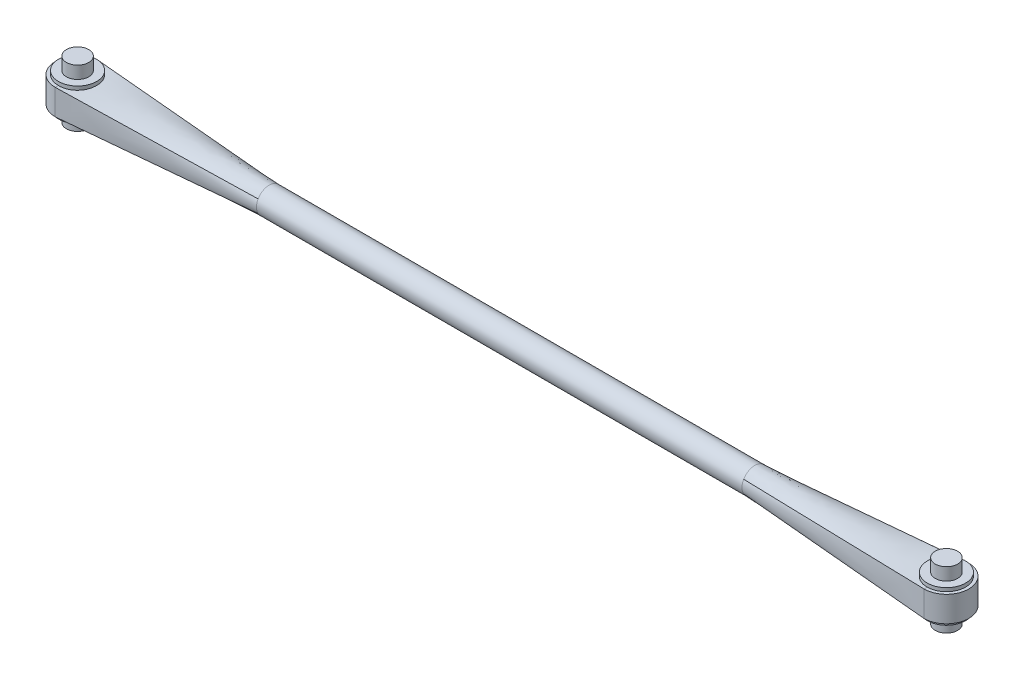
ISO-10303-21;
HEADER;
FILE_DESCRIPTION(('STEP AP214'),'2;1');
FILE_NAME('part.step','',(''),(''),'','','');
FILE_SCHEMA(('AUTOMOTIVE_DESIGN { 1 0 10303 214 1 1 1 1 }'));
ENDSEC;
DATA;
#1=APPLICATION_CONTEXT('core data for automotive mechanical design processes');
#2=APPLICATION_PROTOCOL_DEFINITION('international standard','automotive_design',2000,#1);
#3=PRODUCT_CONTEXT('',#1,'mechanical');
#4=PRODUCT('Part','Part','',(#3));
#5=PRODUCT_RELATED_PRODUCT_CATEGORY('part','',(#4));
#6=PRODUCT_DEFINITION_FORMATION('','',#4);
#7=PRODUCT_DEFINITION_CONTEXT('part definition',#1,'design');
#8=PRODUCT_DEFINITION('design','',#6,#7);
#9=PRODUCT_DEFINITION_SHAPE('','',#8);
#10=(LENGTH_UNIT() NAMED_UNIT(*) SI_UNIT(.MILLI.,.METRE.));
#11=(NAMED_UNIT(*) PLANE_ANGLE_UNIT() SI_UNIT($,.RADIAN.));
#12=(NAMED_UNIT(*) SI_UNIT($,.STERADIAN.) SOLID_ANGLE_UNIT());
#13=UNCERTAINTY_MEASURE_WITH_UNIT(LENGTH_MEASURE(1.E-05),#10,'distance_accuracy_value','');
#14=(GEOMETRIC_REPRESENTATION_CONTEXT(3) GLOBAL_UNCERTAINTY_ASSIGNED_CONTEXT((#13)) GLOBAL_UNIT_ASSIGNED_CONTEXT((#10,
#11,#12)) REPRESENTATION_CONTEXT('',''));
#15=CARTESIAN_POINT('',(0.,0.,0.));
#16=DIRECTION('',(0.,0.,1.));
#17=DIRECTION('',(1.,0.,0.));
#18=AXIS2_PLACEMENT_3D('',#15,#16,#17);
#19=CARTESIAN_POINT('',(1360.,-25.5,0.));
#20=DIRECTION('',(0.,1.,0.));
#21=DIRECTION('',(0.,0.,1.));
#22=AXIS2_PLACEMENT_3D('',#19,#20,#21);
#23=PLANE('',#22);
#24=CARTESIAN_POINT('',(1360.,-25.5,0.));
#25=DIRECTION('',(0.,1.,0.));
#26=DIRECTION('',(0.,0.,1.));
#27=AXIS2_PLACEMENT_3D('',#24,#25,#26);
#28=CIRCLE('',#27,30.);
#29=CARTESIAN_POINT('',(1360.,-25.5,30.));
#30=VERTEX_POINT('',#29);
#31=EDGE_CURVE('E600',#30,#30,#28,.T.);
#32=ORIENTED_EDGE('',*,*,#31,.F.);
#33=EDGE_LOOP('',(#32));
#34=FACE_BOUND('',#33,.T.);
#35=CARTESIAN_POINT('',(1360.,-25.5,0.));
#36=DIRECTION('',(0.,1.,0.));
#37=DIRECTION('',(0.,0.,1.));
#38=AXIS2_PLACEMENT_3D('',#35,#36,#37);
#39=CIRCLE('',#38,17.5);
#40=CARTESIAN_POINT('',(1360.,-25.5,17.5));
#41=VERTEX_POINT('',#40);
#42=EDGE_CURVE('E11',#41,#41,#39,.F.);
#43=ORIENTED_EDGE('',*,*,#42,.F.);
#44=EDGE_LOOP('',(#43));
#45=FACE_BOUND('',#44,.T.);
#46=ADVANCED_FACE('F17',(#34,#45),#23,.F.);
#47=CARTESIAN_POINT('',(1360.,25.5,0.));
#48=DIRECTION('',(0.,1.,0.));
#49=DIRECTION('',(0.,0.,1.));
#50=AXIS2_PLACEMENT_3D('',#47,#48,#49);
#51=PLANE('',#50);
#52=CARTESIAN_POINT('',(1360.,25.5,0.));
#53=DIRECTION('',(0.,1.,0.));
#54=DIRECTION('',(0.,0.,1.));
#55=AXIS2_PLACEMENT_3D('',#52,#53,#54);
#56=CIRCLE('',#55,30.);
#57=CARTESIAN_POINT('',(1360.,25.5,30.));
#58=VERTEX_POINT('',#57);
#59=EDGE_CURVE('E127',#58,#58,#56,.T.);
#60=ORIENTED_EDGE('',*,*,#59,.T.);
#61=EDGE_LOOP('',(#60));
#62=FACE_BOUND('',#61,.T.);
#63=CARTESIAN_POINT('',(1360.,25.5,0.));
#64=DIRECTION('',(0.,1.,0.));
#65=DIRECTION('',(0.,0.,1.));
#66=AXIS2_PLACEMENT_3D('',#63,#64,#65);
#67=CIRCLE('',#66,17.5);
#68=CARTESIAN_POINT('',(1360.,25.5,17.5));
#69=VERTEX_POINT('',#68);
#70=EDGE_CURVE('E24',#69,#69,#67,.F.);
#71=ORIENTED_EDGE('',*,*,#70,.T.);
#72=EDGE_LOOP('',(#71));
#73=FACE_BOUND('',#72,.T.);
#74=ADVANCED_FACE('F589',(#62,#73),#51,.T.);
#75=CARTESIAN_POINT('',(0.,-25.5,0.));
#76=DIRECTION('',(0.,1.,0.));
#77=DIRECTION('',(0.,0.,1.));
#78=AXIS2_PLACEMENT_3D('',#75,#76,#77);
#79=PLANE('',#78);
#80=CARTESIAN_POINT('',(0.,-25.5,0.));
#81=DIRECTION('',(0.,1.,0.));
#82=DIRECTION('',(0.,0.,1.));
#83=AXIS2_PLACEMENT_3D('',#80,#81,#82);
#84=CIRCLE('',#83,30.);
#85=CARTESIAN_POINT('',(0.,-25.5,30.));
#86=VERTEX_POINT('',#85);
#87=EDGE_CURVE('E532',#86,#86,#84,.T.);
#88=ORIENTED_EDGE('',*,*,#87,.F.);
#89=EDGE_LOOP('',(#88));
#90=FACE_BOUND('',#89,.T.);
#91=CARTESIAN_POINT('',(0.,-25.5,0.));
#92=DIRECTION('',(0.,1.,0.));
#93=DIRECTION('',(0.,0.,1.));
#94=AXIS2_PLACEMENT_3D('',#91,#92,#93);
#95=CIRCLE('',#94,17.5);
#96=CARTESIAN_POINT('',(0.,-25.5,17.5));
#97=VERTEX_POINT('',#96);
#98=EDGE_CURVE('E29',#97,#97,#95,.F.);
#99=ORIENTED_EDGE('',*,*,#98,.F.);
#100=EDGE_LOOP('',(#99));
#101=FACE_BOUND('',#100,.T.);
#102=ADVANCED_FACE('F552',(#90,#101),#79,.F.);
#103=CARTESIAN_POINT('',(0.,25.5,0.));
#104=DIRECTION('',(0.,1.,0.));
#105=DIRECTION('',(0.,0.,1.));
#106=AXIS2_PLACEMENT_3D('',#103,#104,#105);
#107=PLANE('',#106);
#108=CARTESIAN_POINT('',(0.,25.5,0.));
#109=DIRECTION('',(0.,1.,0.));
#110=DIRECTION('',(0.,0.,1.));
#111=AXIS2_PLACEMENT_3D('',#108,#109,#110);
#112=CIRCLE('',#111,30.);
#113=CARTESIAN_POINT('',(0.,25.5,30.));
#114=VERTEX_POINT('',#113);
#115=EDGE_CURVE('E511',#114,#114,#112,.T.);
#116=ORIENTED_EDGE('',*,*,#115,.T.);
#117=EDGE_LOOP('',(#116));
#118=FACE_BOUND('',#117,.T.);
#119=CARTESIAN_POINT('',(0.,25.5,0.));
#120=DIRECTION('',(0.,1.,0.));
#121=DIRECTION('',(0.,0.,1.));
#122=AXIS2_PLACEMENT_3D('',#119,#120,#121);
#123=CIRCLE('',#122,17.5);
#124=CARTESIAN_POINT('',(0.,25.5,17.5));
#125=VERTEX_POINT('',#124);
#126=EDGE_CURVE('E641',#125,#125,#123,.F.);
#127=ORIENTED_EDGE('',*,*,#126,.T.);
#128=EDGE_LOOP('',(#127));
#129=FACE_BOUND('',#128,.T.);
#130=ADVANCED_FACE('F488',(#118,#129),#107,.T.);
#131=CARTESIAN_POINT('',(1360.,20.,-35.));
#132=CARTESIAN_POINT('',(1060.,9.92277876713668,-17.3648628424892));
#133=CARTESIAN_POINT('',(1360.,20.,-32.0833333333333));
#134=CARTESIAN_POINT('',(1060.,11.1791890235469,-16.6469141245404));
#135=CARTESIAN_POINT('',(1360.,20.,-29.1666666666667));
#136=CARTESIAN_POINT('',(1060.,12.4391782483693,-15.7452144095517));
#137=CARTESIAN_POINT('',(1360.,20.,-23.3333333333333));
#138=CARTESIAN_POINT('',(1060.,14.8196173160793,-13.5286316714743));
#139=CARTESIAN_POINT('',(1360.,20.,-20.4166666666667));
#140=CARTESIAN_POINT('',(1060.,15.9387798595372,-12.2122329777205));
#141=CARTESIAN_POINT('',(1360.,20.,-14.5833333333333));
#142=CARTESIAN_POINT('',(1060.,17.8487824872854,-9.19805965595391));
#143=CARTESIAN_POINT('',(1360.,20.,-11.6666666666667));
#144=CARTESIAN_POINT('',(1060.,18.6370329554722,-7.50001684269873));
#145=CARTESIAN_POINT('',(1360.,20.,-7.29166666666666));
#146=CARTESIAN_POINT('',(1060.,19.4446142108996,-4.77538382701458));
#147=CARTESIAN_POINT('',(1360.,20.,-5.83333333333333));
#148=CARTESIAN_POINT('',(1060.,19.6517604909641,-3.83849261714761));
#149=CARTESIAN_POINT('',(1360.,20.,-2.91666666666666));
#150=CARTESIAN_POINT('',(1060.,19.9294752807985,-1.93435544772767));
#151=CARTESIAN_POINT('',(1360.,20.,-1.45833333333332));
#152=CARTESIAN_POINT('',(1060.,20.,-0.967204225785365));
#153=CARTESIAN_POINT('',(1360.,20.,1.45833333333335));
#154=CARTESIAN_POINT('',(1060.,20.,0.967204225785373));
#155=CARTESIAN_POINT('',(1360.,20.,2.91666666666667));
#156=CARTESIAN_POINT('',(1060.,19.9294752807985,1.93435544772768));
#157=CARTESIAN_POINT('',(1360.,20.,5.83333333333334));
#158=CARTESIAN_POINT('',(1060.,19.6517604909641,3.83849261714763));
#159=CARTESIAN_POINT('',(1360.,20.,7.29166666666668));
#160=CARTESIAN_POINT('',(1060.,19.4446142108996,4.77538382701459));
#161=CARTESIAN_POINT('',(1360.,20.,11.6666666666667));
#162=CARTESIAN_POINT('',(1060.,18.6370329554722,7.50001684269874));
#163=CARTESIAN_POINT('',(1360.,20.,14.5833333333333));
#164=CARTESIAN_POINT('',(1060.,17.8487824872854,9.19805965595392));
#165=CARTESIAN_POINT('',(1360.,20.,20.4166666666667));
#166=CARTESIAN_POINT('',(1060.,15.9387798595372,12.2122329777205));
#167=CARTESIAN_POINT('',(1360.,20.,23.3333333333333));
#168=CARTESIAN_POINT('',(1060.,14.8196173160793,13.5286316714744));
#169=CARTESIAN_POINT('',(1360.,20.,29.1666666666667));
#170=CARTESIAN_POINT('',(1060.,12.4391782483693,15.7452144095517));
#171=CARTESIAN_POINT('',(1360.,20.,32.0833333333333));
#172=CARTESIAN_POINT('',(1060.,11.1791890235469,16.6469141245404));
#173=CARTESIAN_POINT('',(1360.,20.,35.));
#174=CARTESIAN_POINT('',(1060.,9.92277876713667,17.3648628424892));
#175=B_SPLINE_SURFACE_WITH_KNOTS('',3,1,((#131,#132),(#133,#134),(#135,#136),(#137,#138),(#139,
#140),(#141,#142),(#143,#144),(#145,#146),(#147,#148),(#149,#150),(#151,#152),(#153,#154),(#155,
#156),(#157,#158),(#159,#160),(#161,#162),(#163,#164),(#165,#166),(#167,#168),(#169,#170),(#171,
#172),(#173,#174)),.UNSPECIFIED.,.F.,.F.,.F.,(4,2,2,2,2,2,2,2,2,2,4),(2,2),(0.,0.125,0.25,0.375,
0.4375,0.5,0.5625,0.625,0.75,0.875,1.),(0.,1.),.UNSPECIFIED.);
#176=CARTESIAN_POINT('',(1360.,20.,35.));
#177=CARTESIAN_POINT('',(1360.,20.,34.7916666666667));
#178=CARTESIAN_POINT('',(1360.,20.,34.5833333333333));
#179=CARTESIAN_POINT('',(1360.,20.,34.1666666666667));
#180=CARTESIAN_POINT('',(1360.,20.,33.9583333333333));
#181=CARTESIAN_POINT('',(1360.,20.,33.5416666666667));
#182=CARTESIAN_POINT('',(1360.,20.,33.3333333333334));
#183=CARTESIAN_POINT('',(1360.,20.,32.9166666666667));
#184=CARTESIAN_POINT('',(1360.,20.,32.7083333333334));
#185=CARTESIAN_POINT('',(1360.,20.,32.2916666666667));
#186=CARTESIAN_POINT('',(1360.,20.,32.0833333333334));
#187=CARTESIAN_POINT('',(1360.,20.,31.6666666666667));
#188=CARTESIAN_POINT('',(1360.,20.,31.4583333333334));
#189=CARTESIAN_POINT('',(1360.,20.,31.0416666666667));
#190=CARTESIAN_POINT('',(1360.,20.,30.8333333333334));
#191=CARTESIAN_POINT('',(1360.,20.,30.4166666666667));
#192=CARTESIAN_POINT('',(1360.,20.,30.2083333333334));
#193=CARTESIAN_POINT('',(1360.,20.,30.0000000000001));
#194=B_SPLINE_CURVE_WITH_KNOTS('',3,(#176,#177,#178,#179,#180,#181,#182,#183,#184,#185,#186,
#187,#188,#189,#190,#191,#192,#193),.UNSPECIFIED.,.F.,.F.,(4,2,2,2,2,2,2,2,4),(0.,
0.624999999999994,1.24999999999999,1.87499999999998,2.49999999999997,3.12499999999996,
3.74999999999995,4.37499999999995,4.99999999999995),.UNSPECIFIED.);
#195=CARTESIAN_POINT('',(1360.,20.,30.));
#196=VERTEX_POINT('',#195);
#197=CARTESIAN_POINT('',(1360.,20.,35.));
#198=VERTEX_POINT('',#197);
#199=EDGE_CURVE('E190',#196,#198,#194,.F.);
#200=CARTESIAN_POINT('',(1360.,20.,30.));
#201=CARTESIAN_POINT('',(1359.43782903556,19.98513353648,30.0000175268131));
#202=CARTESIAN_POINT('',(1358.8756616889,19.9702037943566,29.9841988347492));
#203=CARTESIAN_POINT('',(1357.75312039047,19.9404928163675,29.9210170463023));
#204=CARTESIAN_POINT('',(1357.1927463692,19.9257115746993,29.8736551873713));
#205=CARTESIAN_POINT('',(1356.07554115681,19.8965716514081,29.747515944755));
#206=CARTESIAN_POINT('',(1355.51870991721,19.8822129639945,29.668738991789));
#207=CARTESIAN_POINT('',(1354.41067280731,19.8541976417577,29.4800789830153));
#208=CARTESIAN_POINT('',(1353.85946374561,19.8405405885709,29.3702147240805));
#209=CARTESIAN_POINT('',(1352.7640614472,19.8141816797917,29.1196982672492));
#210=CARTESIAN_POINT('',(1352.21986812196,19.8014798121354,28.9790464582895));
#211=CARTESIAN_POINT('',(1351.14024820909,19.7772801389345,28.6674128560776));
#212=CARTESIAN_POINT('',(1350.60482156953,19.7657823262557,28.4964312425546));
#213=CARTESIAN_POINT('',(1349.27885192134,19.7388237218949,28.03154677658));
#214=CARTESIAN_POINT('',(1348.49475765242,19.724259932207,27.7189544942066));
#215=CARTESIAN_POINT('',(1346.95569807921,19.6990406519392,27.0288297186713));
#216=CARTESIAN_POINT('',(1346.20073307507,19.6883852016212,26.651296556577));
#217=CARTESIAN_POINT('',(1344.72541599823,19.6714863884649,25.8340460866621));
#218=CARTESIAN_POINT('',(1344.00505533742,19.665241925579,25.3943443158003));
#219=CARTESIAN_POINT('',(1342.60391738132,19.6574443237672,24.4558241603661));
#220=CARTESIAN_POINT('',(1341.92313984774,19.6558911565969,23.9570061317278));
#221=CARTESIAN_POINT('',(1340.60700591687,19.6574964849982,22.9045988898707));
#222=CARTESIAN_POINT('',(1339.97158293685,19.6606479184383,22.3510929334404));
#223=CARTESIAN_POINT('',(1338.74955441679,19.6713813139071,21.1926264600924));
#224=CARTESIAN_POINT('',(1338.16294891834,19.6789632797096,20.5876658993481));
#225=CARTESIAN_POINT('',(1337.04261454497,19.69798600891,19.3304810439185));
#226=CARTESIAN_POINT('',(1336.50889520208,19.7094274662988,18.6782482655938));
#227=CARTESIAN_POINT('',(1335.49822683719,19.735299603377,17.3312458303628));
#228=CARTESIAN_POINT('',(1335.02127786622,19.7497302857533,16.6364761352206));
#229=CARTESIAN_POINT('',(1334.1273677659,19.7804312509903,15.2090849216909));
#230=CARTESIAN_POINT('',(1333.71042628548,19.7967021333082,14.4764511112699));
#231=CARTESIAN_POINT('',(1332.93965547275,19.8297777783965,12.9787164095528));
#232=CARTESIAN_POINT('',(1332.58582616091,19.8465825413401,12.2136155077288));
#233=CARTESIAN_POINT('',(1331.94379933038,19.8793129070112,10.6563987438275));
#234=CARTESIAN_POINT('',(1331.65559722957,19.8952385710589,9.86428477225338));
#235=CARTESIAN_POINT('',(1331.1468351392,19.924774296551,8.25858081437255));
#236=CARTESIAN_POINT('',(1330.92627515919,19.9383843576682,7.44499082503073));
#237=CARTESIAN_POINT('',(1330.55408162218,19.9621289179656,5.80081452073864));
#238=CARTESIAN_POINT('',(1330.40255553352,19.9722579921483,4.97020379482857));
#239=CARTESIAN_POINT('',(1330.17002490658,19.9880601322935,3.29912534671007));
#240=CARTESIAN_POINT('',(1330.08902041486,19.9937331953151,2.45865761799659));
#241=CARTESIAN_POINT('',(1329.99811938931,20.0001155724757,0.773862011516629));
#242=CARTESIAN_POINT('',(1329.98822320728,20.0008248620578,-0.0704658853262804));
#243=CARTESIAN_POINT('',(1330.03961170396,19.9972039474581,-1.75694062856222));
#244=CARTESIAN_POINT('',(1330.10089626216,19.9928737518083,-2.59908747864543));
#245=CARTESIAN_POINT('',(1330.29397275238,19.9795902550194,-4.27320210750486));
#246=CARTESIAN_POINT('',(1330.4255976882,19.9706479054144,-5.10518924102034));
#247=CARTESIAN_POINT('',(1330.75830416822,19.9489791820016,-6.75510582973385));
#248=CARTESIAN_POINT('',(1330.95938564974,19.9362528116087,-7.57303529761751));
#249=CARTESIAN_POINT('',(1331.42957707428,19.9081269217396,-9.18907626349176));
#250=CARTESIAN_POINT('',(1331.69868882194,19.8927273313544,-9.98718723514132));
#251=CARTESIAN_POINT('',(1332.30303161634,19.8606388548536,-11.5579441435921));
#252=CARTESIAN_POINT('',(1332.63826279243,19.8439499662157,-12.330590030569));
#253=CARTESIAN_POINT('',(1333.37309012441,19.8106877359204,-13.8462315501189));
#254=CARTESIAN_POINT('',(1333.77279210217,19.7941146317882,-14.5891758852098));
#255=CARTESIAN_POINT('',(1334.63334125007,19.7624513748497,-16.0388002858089));
#256=CARTESIAN_POINT('',(1335.09418847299,19.7473612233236,-16.7454803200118));
#257=CARTESIAN_POINT('',(1336.07373999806,19.7198760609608,-18.1175199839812));
#258=CARTESIAN_POINT('',(1336.59244036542,19.7074808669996,-18.7828824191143));
#259=CARTESIAN_POINT('',(1337.68404724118,19.6863436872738,-20.0676055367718));
#260=CARTESIAN_POINT('',(1338.25695360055,19.6776016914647,-20.6869663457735));
#261=CARTESIAN_POINT('',(1339.4529031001,19.6644296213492,-21.8752678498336));
#262=CARTESIAN_POINT('',(1340.07594536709,19.6599994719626,-22.4442094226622));
#263=CARTESIAN_POINT('',(1341.3677096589,19.6558046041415,-23.5276108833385));
#264=CARTESIAN_POINT('',(1342.03643203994,19.656039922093,-24.0420703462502));
#265=CARTESIAN_POINT('',(1343.41512889,19.6612354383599,-25.0130553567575));
#266=CARTESIAN_POINT('',(1344.12511661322,19.6661971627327,-25.4695621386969));
#267=CARTESIAN_POINT('',(1345.21676222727,19.6770180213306,-26.10811692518));
#268=CARTESIAN_POINT('',(1345.58510029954,19.6811882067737,-26.3132734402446));
#269=CARTESIAN_POINT('',(1346.33017909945,19.6906031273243,-26.7079342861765));
#270=CARTESIAN_POINT('',(1346.70692195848,19.6958481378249,-26.8974345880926));
#271=CARTESIAN_POINT('',(1347.84766919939,19.7130918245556,-27.4413889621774));
#272=CARTESIAN_POINT('',(1348.62322207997,19.7266096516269,-27.7718986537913));
#273=CARTESIAN_POINT('',(1350.19933088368,19.7570759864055,-28.3664637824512));
#274=CARTESIAN_POINT('',(1350.9998866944,19.7740244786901,-28.6305195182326));
#275=CARTESIAN_POINT('',(1352.2145508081,19.8014297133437,-28.9752281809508));
#276=CARTESIAN_POINT('',(1352.62155616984,19.810890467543,-29.0815319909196));
#277=CARTESIAN_POINT('',(1353.43959117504,19.8303693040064,-29.2769154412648));
#278=CARTESIAN_POINT('',(1353.85061983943,19.8403872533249,-29.3659991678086));
#279=CARTESIAN_POINT('',(1354.67589286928,19.8608700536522,-29.5267770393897));
#280=CARTESIAN_POINT('',(1355.09013601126,19.8713347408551,-29.598477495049));
#281=CARTESIAN_POINT('',(1355.92125538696,19.8926026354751,-29.7244094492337));
#282=CARTESIAN_POINT('',(1356.33813162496,19.9034058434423,-29.778640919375));
#283=CARTESIAN_POINT('',(1357.29497164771,19.9284030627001,-29.882715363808));
#284=CARTESIAN_POINT('',(1357.83557717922,19.9426719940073,-29.9267265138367));
#285=CARTESIAN_POINT('',(1358.91746373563,19.9713138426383,-29.9853528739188));
#286=CARTESIAN_POINT('',(1359.45874209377,19.9856865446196,-30.000017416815));
#287=CARTESIAN_POINT('',(1360.,20.,-30.));
#288=B_SPLINE_CURVE_WITH_KNOTS('',3,(#200,#201,#202,#203,#204,#205,#206,#207,#208,#209,#210,
#211,#212,#213,#214,#215,#216,#217,#218,#219,#220,#221,#222,#223,#224,#225,#226,#227,#228,#229,
#230,#231,#232,#233,#234,#235,#236,#237,#238,#239,#240,#241,#242,#243,#244,#245,#246,#247,#248,
#249,#250,#251,#252,#253,#254,#255,#256,#257,#258,#259,#260,#261,#262,#263,#264,#265,#266,#267,
#268,#269,#270,#271,#272,#273,#274,#275,#276,#277,#278,#279,#280,#281,#282,#283,#284,#285,#286,
#287),.UNSPECIFIED.,.F.,.F.,(4,2,2,2,2,2,2,2,2,2,2,2,2,2,2,2,2,2,2,2,2,2,2,2,2,2,2,2,2,2,2,2,2,
2,2,2,2,2,2,2,2,2,2,4),(0.,1.68687715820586,3.37368814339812,5.06047600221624,6.74624611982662,
8.43199494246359,10.1177337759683,12.6472447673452,15.1767818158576,17.7056878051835,
20.2345785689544,22.7596770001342,25.2847775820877,27.8103324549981,30.3358895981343,
32.8622718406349,35.3886549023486,37.9148615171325,40.4410684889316,42.9711948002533,
45.5013227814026,48.0314632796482,50.5615994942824,53.085755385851,55.6099089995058,
58.1341295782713,60.6583550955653,63.186766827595,65.715180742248,68.2434227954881,
70.7716578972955,73.2998489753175,75.8280597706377,78.3570871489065,79.6216816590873,
80.8866005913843,83.4128711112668,85.9391302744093,87.201115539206,88.4628009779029,
89.7240277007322,90.9852564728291,92.6121815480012,94.2363693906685),.UNSPECIFIED.);
#289=CARTESIAN_POINT('',(1360.,20.,-30.));
#290=VERTEX_POINT('',#289);
#291=EDGE_CURVE('E509',#196,#290,#288,.T.);
#292=CARTESIAN_POINT('',(1360.,20.,-30.0000000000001));
#293=CARTESIAN_POINT('',(1360.,20.,-30.2083333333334));
#294=CARTESIAN_POINT('',(1360.,20.,-30.4166666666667));
#295=CARTESIAN_POINT('',(1360.,20.,-30.8333333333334));
#296=CARTESIAN_POINT('',(1360.,20.,-31.0416666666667));
#297=CARTESIAN_POINT('',(1360.,20.,-31.4583333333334));
#298=CARTESIAN_POINT('',(1360.,20.,-31.6666666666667));
#299=CARTESIAN_POINT('',(1360.,20.,-32.0833333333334));
#300=CARTESIAN_POINT('',(1360.,20.,-32.2916666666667));
#301=CARTESIAN_POINT('',(1360.,20.,-32.7083333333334));
#302=CARTESIAN_POINT('',(1360.,20.,-32.9166666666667));
#303=CARTESIAN_POINT('',(1360.,20.,-33.3333333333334));
#304=CARTESIAN_POINT('',(1360.,20.,-33.5416666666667));
#305=CARTESIAN_POINT('',(1360.,20.,-33.9583333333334));
#306=CARTESIAN_POINT('',(1360.,20.,-34.1666666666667));
#307=CARTESIAN_POINT('',(1360.,20.,-34.5833333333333));
#308=CARTESIAN_POINT('',(1360.,20.,-34.7916666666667));
#309=CARTESIAN_POINT('',(1360.,20.,-35.));
#310=B_SPLINE_CURVE_WITH_KNOTS('',3,(#292,#293,#294,#295,#296,#297,#298,#299,#300,#301,#302,
#303,#304,#305,#306,#307,#308,#309),.UNSPECIFIED.,.F.,.F.,(4,2,2,2,2,2,2,2,4),(0.,
0.624999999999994,1.24999999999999,1.87499999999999,2.49999999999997,3.12499999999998,
3.74999999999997,4.37499999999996,4.99999999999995),.UNSPECIFIED.);
#311=CARTESIAN_POINT('',(1360.,20.,-35.));
#312=VERTEX_POINT('',#311);
#313=EDGE_CURVE('E177',#312,#290,#310,.F.);
#314=DIRECTION('',(0.997715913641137,0.0335140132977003,-0.0586495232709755));
#315=VECTOR('',#314,1.);
#316=CARTESIAN_POINT('',(1210.,14.9613893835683,-26.1824314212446));
#317=LINE('',#316,#315);
#318=CARTESIAN_POINT('',(1060.,9.92348990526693,-17.3661177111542));
#319=VERTEX_POINT('',#318);
#320=EDGE_CURVE('E561',#319,#312,#317,.T.);
#321=CARTESIAN_POINT('',(1060.,9.92277876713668,-17.3648628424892));
#322=CARTESIAN_POINT('',(1060.,11.1791890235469,-16.6469141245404));
#323=CARTESIAN_POINT('',(1060.,12.4391782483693,-15.7452144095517));
#324=CARTESIAN_POINT('',(1060.,14.8196173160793,-13.5286316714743));
#325=CARTESIAN_POINT('',(1060.,15.9387798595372,-12.2122329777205));
#326=CARTESIAN_POINT('',(1060.,17.8487824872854,-9.19805965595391));
#327=CARTESIAN_POINT('',(1060.,18.6370329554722,-7.50001684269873));
#328=CARTESIAN_POINT('',(1060.,19.4446142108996,-4.77538382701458));
#329=CARTESIAN_POINT('',(1060.,19.6517604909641,-3.83849261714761));
#330=CARTESIAN_POINT('',(1060.,19.9294752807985,-1.93435544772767));
#331=CARTESIAN_POINT('',(1060.,20.,-0.967204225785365));
#332=CARTESIAN_POINT('',(1060.,20.,0.967204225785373));
#333=CARTESIAN_POINT('',(1060.,19.9294752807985,1.93435544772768));
#334=CARTESIAN_POINT('',(1060.,19.6517604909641,3.83849261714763));
#335=CARTESIAN_POINT('',(1060.,19.4446142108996,4.77538382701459));
#336=CARTESIAN_POINT('',(1060.,18.6370329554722,7.50001684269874));
#337=CARTESIAN_POINT('',(1060.,17.8487824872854,9.19805965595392));
#338=CARTESIAN_POINT('',(1060.,15.9387798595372,12.2122329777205));
#339=CARTESIAN_POINT('',(1060.,14.8196173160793,13.5286316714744));
#340=CARTESIAN_POINT('',(1060.,12.4391782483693,15.7452144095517));
#341=CARTESIAN_POINT('',(1060.,11.1791890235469,16.6469141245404));
#342=CARTESIAN_POINT('',(1060.,9.92277876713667,17.3648628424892));
#343=B_SPLINE_CURVE_WITH_KNOTS('',3,(#321,#322,#323,#324,#325,#326,#327,#328,#329,#330,#331,
#332,#333,#334,#335,#336,#337,#338,#339,#340,#341,#342),.UNSPECIFIED.,.F.,.F.,(4,2,2,2,2,2,2,2,
2,2,4),(0.,0.125,0.25,0.375,0.4375,0.5,0.5625,0.625,0.75,0.875,1.),.UNSPECIFIED.);
#344=CARTESIAN_POINT('',(1060.,9.9234781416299,17.3660971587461));
#345=VERTEX_POINT('',#344);
#346=EDGE_CURVE('E198',#319,#345,#343,.T.);
#347=DIRECTION('',(-0.997715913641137,-0.0335140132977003,-0.0586495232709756));
#348=VECTOR('',#347,1.);
#349=CARTESIAN_POINT('',(1210.,14.9613893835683,26.1824314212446));
#350=LINE('',#349,#348);
#351=EDGE_CURVE('E566',#198,#345,#350,.T.);
#352=ORIENTED_EDGE('',*,*,#199,.F.);
#353=ORIENTED_EDGE('',*,*,#291,.T.);
#354=ORIENTED_EDGE('',*,*,#313,.F.);
#355=ORIENTED_EDGE('',*,*,#320,.F.);
#356=ORIENTED_EDGE('',*,*,#346,.T.);
#357=ORIENTED_EDGE('',*,*,#351,.F.);
#358=EDGE_LOOP('',(#352,#353,#354,#355,#356,#357));
#359=FACE_BOUND('',#358,.T.);
#360=ADVANCED_FACE('F478',(#359),#175,.F.);
#361=CARTESIAN_POINT('',(1360.,-20.,35.));
#362=CARTESIAN_POINT('',(1060.,-9.92277876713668,17.3648628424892));
#363=CARTESIAN_POINT('',(1360.,-20.,32.0833333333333));
#364=CARTESIAN_POINT('',(1060.,-11.1791890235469,16.6469141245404));
#365=CARTESIAN_POINT('',(1360.,-20.,29.1666666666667));
#366=CARTESIAN_POINT('',(1060.,-12.4391782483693,15.7452144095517));
#367=CARTESIAN_POINT('',(1360.,-20.,23.3333333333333));
#368=CARTESIAN_POINT('',(1060.,-14.8196173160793,13.5286316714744));
#369=CARTESIAN_POINT('',(1360.,-20.,20.4166666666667));
#370=CARTESIAN_POINT('',(1060.,-15.9387798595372,12.2122329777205));
#371=CARTESIAN_POINT('',(1360.,-20.,14.5833333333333));
#372=CARTESIAN_POINT('',(1060.,-17.8487824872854,9.19805965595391));
#373=CARTESIAN_POINT('',(1360.,-20.,11.6666666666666));
#374=CARTESIAN_POINT('',(1060.,-18.6370329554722,7.50001684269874));
#375=CARTESIAN_POINT('',(1360.,-20.,7.29166666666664));
#376=CARTESIAN_POINT('',(1060.,-19.4446142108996,4.77538382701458));
#377=CARTESIAN_POINT('',(1360.,-20.,5.83333333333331));
#378=CARTESIAN_POINT('',(1060.,-19.6517604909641,3.83849261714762));
#379=CARTESIAN_POINT('',(1360.,-20.,2.91666666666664));
#380=CARTESIAN_POINT('',(1060.,-19.9294752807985,1.93435544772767));
#381=CARTESIAN_POINT('',(1360.,-20.,1.45833333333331));
#382=CARTESIAN_POINT('',(1060.,-20.,0.967204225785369));
#383=CARTESIAN_POINT('',(1360.,-20.,-1.45833333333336));
#384=CARTESIAN_POINT('',(1060.,-20.,-0.967204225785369));
#385=CARTESIAN_POINT('',(1360.,-20.,-2.91666666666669));
#386=CARTESIAN_POINT('',(1060.,-19.9294752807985,-1.93435544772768));
#387=CARTESIAN_POINT('',(1360.,-20.,-5.83333333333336));
#388=CARTESIAN_POINT('',(1060.,-19.6517604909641,-3.83849261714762));
#389=CARTESIAN_POINT('',(1360.,-20.,-7.29166666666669));
#390=CARTESIAN_POINT('',(1060.,-19.4446142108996,-4.77538382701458));
#391=CARTESIAN_POINT('',(1360.,-20.,-11.6666666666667));
#392=CARTESIAN_POINT('',(1060.,-18.6370329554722,-7.50001684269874));
#393=CARTESIAN_POINT('',(1360.,-20.,-14.5833333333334));
#394=CARTESIAN_POINT('',(1060.,-17.8487824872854,-9.19805965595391));
#395=CARTESIAN_POINT('',(1360.,-20.,-20.4166666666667));
#396=CARTESIAN_POINT('',(1060.,-15.9387798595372,-12.2122329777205));
#397=CARTESIAN_POINT('',(1360.,-20.,-23.3333333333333));
#398=CARTESIAN_POINT('',(1060.,-14.8196173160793,-13.5286316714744));
#399=CARTESIAN_POINT('',(1360.,-20.,-29.1666666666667));
#400=CARTESIAN_POINT('',(1060.,-12.4391782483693,-15.7452144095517));
#401=CARTESIAN_POINT('',(1360.,-20.,-32.0833333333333));
#402=CARTESIAN_POINT('',(1060.,-11.1791890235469,-16.6469141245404));
#403=CARTESIAN_POINT('',(1360.,-20.,-35.));
#404=CARTESIAN_POINT('',(1060.,-9.92277876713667,-17.3648628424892));
#405=B_SPLINE_SURFACE_WITH_KNOTS('',3,1,((#361,#362),(#363,#364),(#365,#366),(#367,#368),(#369,
#370),(#371,#372),(#373,#374),(#375,#376),(#377,#378),(#379,#380),(#381,#382),(#383,#384),(#385,
#386),(#387,#388),(#389,#390),(#391,#392),(#393,#394),(#395,#396),(#397,#398),(#399,#400),(#401,
#402),(#403,#404)),.UNSPECIFIED.,.F.,.F.,.F.,(4,2,2,2,2,2,2,2,2,2,4),(2,2),(0.,0.125,0.25,0.375,
0.4375,0.5,0.5625,0.625,0.75,0.875,1.),(0.,1.),.UNSPECIFIED.);
#406=CARTESIAN_POINT('',(1360.,-20.,-35.));
#407=CARTESIAN_POINT('',(1360.,-20.,-34.7916666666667));
#408=CARTESIAN_POINT('',(1360.,-20.,-34.5833333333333));
#409=CARTESIAN_POINT('',(1360.,-20.,-34.1666666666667));
#410=CARTESIAN_POINT('',(1360.,-20.,-33.9583333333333));
#411=CARTESIAN_POINT('',(1360.,-20.,-33.5416666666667));
#412=CARTESIAN_POINT('',(1360.,-20.,-33.3333333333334));
#413=CARTESIAN_POINT('',(1360.,-20.,-32.9166666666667));
#414=CARTESIAN_POINT('',(1360.,-20.,-32.7083333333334));
#415=CARTESIAN_POINT('',(1360.,-20.,-32.2916666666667));
#416=CARTESIAN_POINT('',(1360.,-20.,-32.0833333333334));
#417=CARTESIAN_POINT('',(1360.,-20.,-31.6666666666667));
#418=CARTESIAN_POINT('',(1360.,-20.,-31.4583333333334));
#419=CARTESIAN_POINT('',(1360.,-20.,-31.0416666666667));
#420=CARTESIAN_POINT('',(1360.,-20.,-30.8333333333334));
#421=CARTESIAN_POINT('',(1360.,-20.,-30.4166666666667));
#422=CARTESIAN_POINT('',(1360.,-20.,-30.2083333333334));
#423=CARTESIAN_POINT('',(1360.,-20.,-30.0000000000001));
#424=B_SPLINE_CURVE_WITH_KNOTS('',3,(#406,#407,#408,#409,#410,#411,#412,#413,#414,#415,#416,
#417,#418,#419,#420,#421,#422,#423),.UNSPECIFIED.,.F.,.F.,(4,2,2,2,2,2,2,2,4),(0.,
0.624999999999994,1.24999999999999,1.87499999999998,2.49999999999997,3.12499999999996,
3.74999999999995,4.37499999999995,4.99999999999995),.UNSPECIFIED.);
#425=CARTESIAN_POINT('',(1360.,-20.,-35.));
#426=VERTEX_POINT('',#425);
#427=CARTESIAN_POINT('',(1360.,-20.,-30.));
#428=VERTEX_POINT('',#427);
#429=EDGE_CURVE('E125',#426,#428,#424,.T.);
#430=CARTESIAN_POINT('',(1360.,-20.,-30.));
#431=CARTESIAN_POINT('',(1359.43782903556,-19.98513353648,-30.0000175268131));
#432=CARTESIAN_POINT('',(1358.8756616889,-19.9702037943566,-29.9841988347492));
#433=CARTESIAN_POINT('',(1357.75312039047,-19.9404928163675,-29.9210170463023));
#434=CARTESIAN_POINT('',(1357.1927463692,-19.9257115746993,-29.8736551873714));
#435=CARTESIAN_POINT('',(1356.07554115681,-19.8965716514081,-29.7475159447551));
#436=CARTESIAN_POINT('',(1355.51870991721,-19.8822129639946,-29.6687389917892));
#437=CARTESIAN_POINT('',(1354.41067280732,-19.8541976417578,-29.4800789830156));
#438=CARTESIAN_POINT('',(1353.85946374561,-19.8405405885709,-29.3702147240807));
#439=CARTESIAN_POINT('',(1352.7640614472,-19.8141816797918,-29.1196982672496));
#440=CARTESIAN_POINT('',(1352.21986812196,-19.8014798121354,-28.9790464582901));
#441=CARTESIAN_POINT('',(1351.14024820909,-19.7772801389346,-28.667412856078));
#442=CARTESIAN_POINT('',(1350.60482156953,-19.7657823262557,-28.4964312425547));
#443=CARTESIAN_POINT('',(1349.27885192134,-19.7388237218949,-28.03154677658));
#444=CARTESIAN_POINT('',(1348.49475765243,-19.724259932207,-27.7189544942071));
#445=CARTESIAN_POINT('',(1346.95569807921,-19.6990406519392,-27.0288297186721));
#446=CARTESIAN_POINT('',(1346.20073307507,-19.6883852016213,-26.6512965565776));
#447=CARTESIAN_POINT('',(1344.72541599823,-19.6714863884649,-25.8340460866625));
#448=CARTESIAN_POINT('',(1344.00505533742,-19.665241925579,-25.3943443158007));
#449=CARTESIAN_POINT('',(1342.60391738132,-19.6574443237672,-24.4558241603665));
#450=CARTESIAN_POINT('',(1341.92313984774,-19.6558911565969,-23.9570061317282));
#451=CARTESIAN_POINT('',(1340.60700591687,-19.6574964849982,-22.904598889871));
#452=CARTESIAN_POINT('',(1339.97158293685,-19.6606479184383,-22.3510929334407));
#453=CARTESIAN_POINT('',(1338.74955441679,-19.6713813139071,-21.1926264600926));
#454=CARTESIAN_POINT('',(1338.16294891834,-19.6789632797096,-20.5876658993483));
#455=CARTESIAN_POINT('',(1337.04261454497,-19.69798600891,-19.3304810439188));
#456=CARTESIAN_POINT('',(1336.50889520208,-19.7094274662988,-18.6782482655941));
#457=CARTESIAN_POINT('',(1335.49822683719,-19.735299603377,-17.3312458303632));
#458=CARTESIAN_POINT('',(1335.02127786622,-19.7497302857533,-16.6364761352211));
#459=CARTESIAN_POINT('',(1334.1273677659,-19.7804312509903,-15.2090849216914));
#460=CARTESIAN_POINT('',(1333.71042628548,-19.7967021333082,-14.4764511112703));
#461=CARTESIAN_POINT('',(1332.93965547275,-19.8297777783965,-12.9787164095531));
#462=CARTESIAN_POINT('',(1332.58582616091,-19.8465825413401,-12.2136155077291));
#463=CARTESIAN_POINT('',(1331.94379933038,-19.8793129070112,-10.6563987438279));
#464=CARTESIAN_POINT('',(1331.65559722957,-19.8952385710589,-9.86428477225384));
#465=CARTESIAN_POINT('',(1331.1468351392,-19.924774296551,-8.25858081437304));
#466=CARTESIAN_POINT('',(1330.92627515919,-19.9383843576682,-7.4449908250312));
#467=CARTESIAN_POINT('',(1330.55408162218,-19.9621289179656,-5.80081452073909));
#468=CARTESIAN_POINT('',(1330.40255553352,-19.9722579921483,-4.97020379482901));
#469=CARTESIAN_POINT('',(1330.17002490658,-19.9880601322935,-3.29912534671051));
#470=CARTESIAN_POINT('',(1330.08902041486,-19.9937331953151,-2.45865761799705));
#471=CARTESIAN_POINT('',(1329.99811938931,-20.0001155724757,-0.773862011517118));
#472=CARTESIAN_POINT('',(1329.98822320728,-20.0008248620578,0.0704658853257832));
#473=CARTESIAN_POINT('',(1330.03961170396,-19.9972039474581,1.7569406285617));
#474=CARTESIAN_POINT('',(1330.10089626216,-19.9928737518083,2.59908747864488));
#475=CARTESIAN_POINT('',(1330.29397275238,-19.9795902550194,4.27320210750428));
#476=CARTESIAN_POINT('',(1330.4255976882,-19.9706479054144,5.10518924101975));
#477=CARTESIAN_POINT('',(1330.75830416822,-19.9489791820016,6.75510582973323));
#478=CARTESIAN_POINT('',(1330.95938564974,-19.9362528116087,7.57303529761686));
#479=CARTESIAN_POINT('',(1331.42957707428,-19.9081269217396,9.18907626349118));
#480=CARTESIAN_POINT('',(1331.69868882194,-19.8927273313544,9.98718723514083));
#481=CARTESIAN_POINT('',(1332.30303161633,-19.8606388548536,11.5579441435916));
#482=CARTESIAN_POINT('',(1332.63826279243,-19.8439499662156,12.3305900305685));
#483=CARTESIAN_POINT('',(1333.37309012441,-19.8106877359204,13.8462315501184));
#484=CARTESIAN_POINT('',(1333.77279210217,-19.7941146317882,14.5891758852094));
#485=CARTESIAN_POINT('',(1334.63334125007,-19.7624513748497,16.0388002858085));
#486=CARTESIAN_POINT('',(1335.09418847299,-19.7473612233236,16.7454803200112));
#487=CARTESIAN_POINT('',(1336.07373999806,-19.7198760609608,18.1175199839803));
#488=CARTESIAN_POINT('',(1336.59244036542,-19.7074808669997,18.7828824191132));
#489=CARTESIAN_POINT('',(1337.68404724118,-19.6863436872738,20.067605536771));
#490=CARTESIAN_POINT('',(1338.25695360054,-19.6776016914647,20.6869663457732));
#491=CARTESIAN_POINT('',(1339.4529031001,-19.6644296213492,21.8752678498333));
#492=CARTESIAN_POINT('',(1340.07594536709,-19.6599994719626,22.4442094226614));
#493=CARTESIAN_POINT('',(1341.3677096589,-19.6558046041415,23.5276108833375));
#494=CARTESIAN_POINT('',(1342.03643203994,-19.656039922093,24.0420703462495));
#495=CARTESIAN_POINT('',(1343.41512889,-19.6612354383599,25.0130553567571));
#496=CARTESIAN_POINT('',(1344.12511661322,-19.6661971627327,25.4695621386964));
#497=CARTESIAN_POINT('',(1345.21676222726,-19.6770180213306,26.1081169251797));
#498=CARTESIAN_POINT('',(1345.58510029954,-19.6811882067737,26.3132734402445));
#499=CARTESIAN_POINT('',(1346.33017909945,-19.6906031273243,26.7079342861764));
#500=CARTESIAN_POINT('',(1346.70692195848,-19.6958481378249,26.8974345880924));
#501=CARTESIAN_POINT('',(1347.84766919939,-19.7130918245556,27.4413889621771));
#502=CARTESIAN_POINT('',(1348.62322207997,-19.7266096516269,27.7718986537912));
#503=CARTESIAN_POINT('',(1350.19933088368,-19.7570759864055,28.3664637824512));
#504=CARTESIAN_POINT('',(1350.9998866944,-19.7740244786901,28.6305195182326));
#505=CARTESIAN_POINT('',(1352.2145508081,-19.8014297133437,28.9752281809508));
#506=CARTESIAN_POINT('',(1352.62155616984,-19.810890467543,29.0815319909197));
#507=CARTESIAN_POINT('',(1353.43959117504,-19.8303693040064,29.2769154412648));
#508=CARTESIAN_POINT('',(1353.85061983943,-19.8403872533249,29.3659991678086));
#509=CARTESIAN_POINT('',(1354.67589286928,-19.8608700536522,29.5267770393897));
#510=CARTESIAN_POINT('',(1355.09013601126,-19.8713347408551,29.598477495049));
#511=CARTESIAN_POINT('',(1355.92125538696,-19.8926026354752,29.7244094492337));
#512=CARTESIAN_POINT('',(1356.33813162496,-19.9034058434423,29.778640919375));
#513=CARTESIAN_POINT('',(1357.29497164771,-19.9284030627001,29.882715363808));
#514=CARTESIAN_POINT('',(1357.83557717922,-19.9426719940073,29.9267265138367));
#515=CARTESIAN_POINT('',(1358.91746373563,-19.9713138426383,29.9853528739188));
#516=CARTESIAN_POINT('',(1359.45874209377,-19.9856865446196,30.000017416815));
#517=CARTESIAN_POINT('',(1360.,-20.,30.));
#518=B_SPLINE_CURVE_WITH_KNOTS('',3,(#430,#431,#432,#433,#434,#435,#436,#437,#438,#439,#440,
#441,#442,#443,#444,#445,#446,#447,#448,#449,#450,#451,#452,#453,#454,#455,#456,#457,#458,#459,
#460,#461,#462,#463,#464,#465,#466,#467,#468,#469,#470,#471,#472,#473,#474,#475,#476,#477,#478,
#479,#480,#481,#482,#483,#484,#485,#486,#487,#488,#489,#490,#491,#492,#493,#494,#495,#496,#497,
#498,#499,#500,#501,#502,#503,#504,#505,#506,#507,#508,#509,#510,#511,#512,#513,#514,#515,#516,
#517),.UNSPECIFIED.,.F.,.F.,(4,2,2,2,2,2,2,2,2,2,2,2,2,2,2,2,2,2,2,2,2,2,2,2,2,2,2,2,2,2,2,2,2,
2,2,2,2,2,2,2,2,2,2,4),(0.,1.68687715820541,3.37368814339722,5.06047600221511,6.74624611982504,
8.43199494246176,10.1177337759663,12.6472447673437,15.1767818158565,17.7056878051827,
20.2345785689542,22.7596770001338,25.2847775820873,27.8103324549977,30.3358895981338,
32.8622718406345,35.3886549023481,37.914861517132,40.4410684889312,42.9711948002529,
45.5013227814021,48.0314632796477,50.5615994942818,53.0857553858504,55.6099089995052,
58.1341295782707,60.6583550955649,63.1867668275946,65.7151807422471,68.2434227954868,
70.7716578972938,73.2998489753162,75.8280597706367,78.3570871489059,79.6216816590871,
80.8866005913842,83.4128711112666,85.9391302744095,87.2011155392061,88.462800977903,
89.7240277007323,90.9852564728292,92.6121815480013,94.2363693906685),.UNSPECIFIED.);
#519=CARTESIAN_POINT('',(1360.,-20.,30.));
#520=VERTEX_POINT('',#519);
#521=EDGE_CURVE('E44',#428,#520,#518,.T.);
#522=CARTESIAN_POINT('',(1360.,-20.,30.));
#523=CARTESIAN_POINT('',(1360.,-20.,30.2083333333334));
#524=CARTESIAN_POINT('',(1360.,-20.,30.4166666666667));
#525=CARTESIAN_POINT('',(1360.,-20.,30.8333333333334));
#526=CARTESIAN_POINT('',(1360.,-20.,31.0416666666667));
#527=CARTESIAN_POINT('',(1360.,-20.,31.4583333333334));
#528=CARTESIAN_POINT('',(1360.,-20.,31.6666666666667));
#529=CARTESIAN_POINT('',(1360.,-20.,32.0833333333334));
#530=CARTESIAN_POINT('',(1360.,-20.,32.2916666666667));
#531=CARTESIAN_POINT('',(1360.,-20.,32.7083333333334));
#532=CARTESIAN_POINT('',(1360.,-20.,32.9166666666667));
#533=CARTESIAN_POINT('',(1360.,-20.,33.3333333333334));
#534=CARTESIAN_POINT('',(1360.,-20.,33.5416666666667));
#535=CARTESIAN_POINT('',(1360.,-20.,33.9583333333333));
#536=CARTESIAN_POINT('',(1360.,-20.,34.1666666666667));
#537=CARTESIAN_POINT('',(1360.,-20.,34.5833333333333));
#538=CARTESIAN_POINT('',(1360.,-20.,34.7916666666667));
#539=CARTESIAN_POINT('',(1360.,-20.,35.));
#540=B_SPLINE_CURVE_WITH_KNOTS('',3,(#522,#523,#524,#525,#526,#527,#528,#529,#530,#531,#532,
#533,#534,#535,#536,#537,#538,#539),.UNSPECIFIED.,.F.,.F.,(4,2,2,2,2,2,2,2,4),(0.,
0.625000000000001,1.25,1.87499999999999,2.49999999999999,3.12499999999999,3.74999999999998,
4.37499999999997,4.99999999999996),.UNSPECIFIED.);
#541=CARTESIAN_POINT('',(1360.,-20.,35.));
#542=VERTEX_POINT('',#541);
#543=EDGE_CURVE('E121',#542,#520,#540,.F.);
#544=DIRECTION('',(-0.997715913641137,0.0335140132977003,-0.0586495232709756));
#545=VECTOR('',#544,1.);
#546=CARTESIAN_POINT('',(1210.,-14.9613893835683,26.1824314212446));
#547=LINE('',#546,#545);
#548=CARTESIAN_POINT('',(1060.,-9.92348990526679,17.3661177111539));
#549=VERTEX_POINT('',#548);
#550=EDGE_CURVE('E416',#542,#549,#547,.T.);
#551=CARTESIAN_POINT('',(1060.,-9.92277876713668,17.3648628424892));
#552=CARTESIAN_POINT('',(1060.,-11.1791890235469,16.6469141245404));
#553=CARTESIAN_POINT('',(1060.,-12.4391782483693,15.7452144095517));
#554=CARTESIAN_POINT('',(1060.,-14.8196173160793,13.5286316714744));
#555=CARTESIAN_POINT('',(1060.,-15.9387798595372,12.2122329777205));
#556=CARTESIAN_POINT('',(1060.,-17.8487824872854,9.19805965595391));
#557=CARTESIAN_POINT('',(1060.,-18.6370329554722,7.50001684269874));
#558=CARTESIAN_POINT('',(1060.,-19.4446142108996,4.77538382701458));
#559=CARTESIAN_POINT('',(1060.,-19.6517604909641,3.83849261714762));
#560=CARTESIAN_POINT('',(1060.,-19.9294752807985,1.93435544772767));
#561=CARTESIAN_POINT('',(1060.,-20.,0.967204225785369));
#562=CARTESIAN_POINT('',(1060.,-20.,-0.967204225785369));
#563=CARTESIAN_POINT('',(1060.,-19.9294752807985,-1.93435544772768));
#564=CARTESIAN_POINT('',(1060.,-19.6517604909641,-3.83849261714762));
#565=CARTESIAN_POINT('',(1060.,-19.4446142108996,-4.77538382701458));
#566=CARTESIAN_POINT('',(1060.,-18.6370329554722,-7.50001684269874));
#567=CARTESIAN_POINT('',(1060.,-17.8487824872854,-9.19805965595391));
#568=CARTESIAN_POINT('',(1060.,-15.9387798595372,-12.2122329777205));
#569=CARTESIAN_POINT('',(1060.,-14.8196173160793,-13.5286316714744));
#570=CARTESIAN_POINT('',(1060.,-12.4391782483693,-15.7452144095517));
#571=CARTESIAN_POINT('',(1060.,-11.1791890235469,-16.6469141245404));
#572=CARTESIAN_POINT('',(1060.,-9.92277876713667,-17.3648628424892));
#573=B_SPLINE_CURVE_WITH_KNOTS('',3,(#551,#552,#553,#554,#555,#556,#557,#558,#559,#560,#561,
#562,#563,#564,#565,#566,#567,#568,#569,#570,#571,#572),.UNSPECIFIED.,.F.,.F.,(4,2,2,2,2,2,2,2,
2,2,4),(0.,0.125,0.25,0.375,0.4375,0.5,0.5625,0.625,0.75,0.875,1.),.UNSPECIFIED.);
#574=CARTESIAN_POINT('',(1060.,-9.92347814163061,-17.3660971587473));
#575=VERTEX_POINT('',#574);
#576=EDGE_CURVE('E475',#549,#575,#573,.T.);
#577=DIRECTION('',(-0.997715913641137,0.0335140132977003,0.0586495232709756));
#578=VECTOR('',#577,1.);
#579=CARTESIAN_POINT('',(1210.,-14.9613893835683,-26.1824314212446));
#580=LINE('',#579,#578);
#581=EDGE_CURVE('E408',#426,#575,#580,.T.);
#582=ORIENTED_EDGE('',*,*,#429,.T.);
#583=ORIENTED_EDGE('',*,*,#521,.T.);
#584=ORIENTED_EDGE('',*,*,#543,.F.);
#585=ORIENTED_EDGE('',*,*,#550,.T.);
#586=ORIENTED_EDGE('',*,*,#576,.T.);
#587=ORIENTED_EDGE('',*,*,#581,.F.);
#588=EDGE_LOOP('',(#582,#583,#584,#585,#586,#587));
#589=FACE_BOUND('',#588,.T.);
#590=ADVANCED_FACE('F119',(#589),#405,.F.);
#591=CARTESIAN_POINT('',(1360.,20.,0.));
#592=DIRECTION('',(0.,-1.,0.));
#593=DIRECTION('',(0.,0.,-1.));
#594=AXIS2_PLACEMENT_3D('',#591,#592,#593);
#595=PLANE('',#594);
#596=CARTESIAN_POINT('',(1360.,20.,0.));
#597=DIRECTION('',(0.,-1.,0.));
#598=DIRECTION('',(0.,0.,-1.));
#599=AXIS2_PLACEMENT_3D('',#596,#597,#598);
#600=CIRCLE('',#599,30.);
#601=EDGE_CURVE('E37',#196,#290,#600,.F.);
#602=ORIENTED_EDGE('',*,*,#601,.F.);
#603=ORIENTED_EDGE('',*,*,#199,.T.);
#604=CARTESIAN_POINT('',(1360.,20.,0.));
#605=DIRECTION('',(0.,1.,0.));
#606=DIRECTION('',(0.,0.,-1.));
#607=AXIS2_PLACEMENT_3D('',#604,#605,#606);
#608=CIRCLE('',#607,35.);
#609=EDGE_CURVE('E182',#198,#312,#608,.T.);
#610=ORIENTED_EDGE('',*,*,#609,.T.);
#611=ORIENTED_EDGE('',*,*,#313,.T.);
#612=EDGE_LOOP('',(#602,#603,#610,#611));
#613=FACE_BOUND('',#612,.T.);
#614=ADVANCED_FACE('F156',(#613),#595,.F.);
#615=CARTESIAN_POINT('',(1360.,-20.,0.));
#616=DIRECTION('',(0.,-1.,0.));
#617=DIRECTION('',(0.,0.,-1.));
#618=AXIS2_PLACEMENT_3D('',#615,#616,#617);
#619=PLANE('',#618);
#620=ORIENTED_EDGE('',*,*,#543,.T.);
#621=CARTESIAN_POINT('',(1360.,-20.,0.));
#622=DIRECTION('',(0.,-1.,0.));
#623=DIRECTION('',(0.,0.,-1.));
#624=AXIS2_PLACEMENT_3D('',#621,#622,#623);
#625=CIRCLE('',#624,30.);
#626=EDGE_CURVE('E108',#520,#428,#625,.F.);
#627=ORIENTED_EDGE('',*,*,#626,.T.);
#628=ORIENTED_EDGE('',*,*,#429,.F.);
#629=CARTESIAN_POINT('',(1360.,-20.,0.));
#630=DIRECTION('',(0.,1.,0.));
#631=DIRECTION('',(0.,0.,-1.));
#632=AXIS2_PLACEMENT_3D('',#629,#630,#631);
#633=CIRCLE('',#632,35.);
#634=EDGE_CURVE('E133',#542,#426,#633,.T.);
#635=ORIENTED_EDGE('',*,*,#634,.F.);
#636=EDGE_LOOP('',(#620,#627,#628,#635));
#637=FACE_BOUND('',#636,.T.);
#638=ADVANCED_FACE('F131',(#637),#619,.T.);
#639=CARTESIAN_POINT('',(0.,20.,-35.));
#640=CARTESIAN_POINT('',(300.,9.92277876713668,-17.3648628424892));
#641=CARTESIAN_POINT('',(0.,20.,-32.0833333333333));
#642=CARTESIAN_POINT('',(300.,11.1791890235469,-16.6469141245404));
#643=CARTESIAN_POINT('',(0.,20.,-29.1666666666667));
#644=CARTESIAN_POINT('',(300.,12.4391782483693,-15.7452144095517));
#645=CARTESIAN_POINT('',(0.,20.,-23.3333333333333));
#646=CARTESIAN_POINT('',(300.,14.8196173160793,-13.5286316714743));
#647=CARTESIAN_POINT('',(0.,20.,-20.4166666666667));
#648=CARTESIAN_POINT('',(300.,15.9387798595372,-12.2122329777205));
#649=CARTESIAN_POINT('',(0.,20.,-14.5833333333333));
#650=CARTESIAN_POINT('',(300.,17.8487824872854,-9.19805965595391));
#651=CARTESIAN_POINT('',(0.,20.,-11.6666666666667));
#652=CARTESIAN_POINT('',(300.,18.6370329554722,-7.50001684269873));
#653=CARTESIAN_POINT('',(0.,20.,-7.29166666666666));
#654=CARTESIAN_POINT('',(300.,19.4446142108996,-4.77538382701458));
#655=CARTESIAN_POINT('',(0.,20.,-5.83333333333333));
#656=CARTESIAN_POINT('',(300.,19.6517604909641,-3.83849261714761));
#657=CARTESIAN_POINT('',(0.,20.,-2.91666666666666));
#658=CARTESIAN_POINT('',(300.,19.9294752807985,-1.93435544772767));
#659=CARTESIAN_POINT('',(0.,20.,-1.45833333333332));
#660=CARTESIAN_POINT('',(300.,20.,-0.967204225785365));
#661=CARTESIAN_POINT('',(0.,20.,1.45833333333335));
#662=CARTESIAN_POINT('',(300.,20.,0.967204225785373));
#663=CARTESIAN_POINT('',(0.,20.,2.91666666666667));
#664=CARTESIAN_POINT('',(300.,19.9294752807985,1.93435544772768));
#665=CARTESIAN_POINT('',(0.,20.,5.83333333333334));
#666=CARTESIAN_POINT('',(300.,19.6517604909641,3.83849261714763));
#667=CARTESIAN_POINT('',(0.,20.,7.29166666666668));
#668=CARTESIAN_POINT('',(300.,19.4446142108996,4.77538382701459));
#669=CARTESIAN_POINT('',(0.,20.,11.6666666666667));
#670=CARTESIAN_POINT('',(300.,18.6370329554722,7.50001684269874));
#671=CARTESIAN_POINT('',(0.,20.,14.5833333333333));
#672=CARTESIAN_POINT('',(300.,17.8487824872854,9.19805965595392));
#673=CARTESIAN_POINT('',(0.,20.,20.4166666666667));
#674=CARTESIAN_POINT('',(300.,15.9387798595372,12.2122329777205));
#675=CARTESIAN_POINT('',(0.,20.,23.3333333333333));
#676=CARTESIAN_POINT('',(300.,14.8196173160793,13.5286316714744));
#677=CARTESIAN_POINT('',(0.,20.,29.1666666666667));
#678=CARTESIAN_POINT('',(300.,12.4391782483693,15.7452144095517));
#679=CARTESIAN_POINT('',(0.,20.,32.0833333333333));
#680=CARTESIAN_POINT('',(300.,11.1791890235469,16.6469141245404));
#681=CARTESIAN_POINT('',(0.,20.,35.));
#682=CARTESIAN_POINT('',(300.,9.92277876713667,17.3648628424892));
#683=B_SPLINE_SURFACE_WITH_KNOTS('',3,1,((#639,#640),(#641,#642),(#643,#644),(#645,#646),(#647,
#648),(#649,#650),(#651,#652),(#653,#654),(#655,#656),(#657,#658),(#659,#660),(#661,#662),(#663,
#664),(#665,#666),(#667,#668),(#669,#670),(#671,#672),(#673,#674),(#675,#676),(#677,#678),(#679,
#680),(#681,#682)),.UNSPECIFIED.,.F.,.F.,.F.,(4,2,2,2,2,2,2,2,2,2,4),(2,2),(0.,0.125,0.25,0.375,
0.4375,0.5,0.5625,0.625,0.75,0.875,1.),(0.,1.),.UNSPECIFIED.);
#684=CARTESIAN_POINT('',(0.,20.,-35.));
#685=CARTESIAN_POINT('',(0.,20.,-34.7916666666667));
#686=CARTESIAN_POINT('',(0.,20.,-34.5833333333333));
#687=CARTESIAN_POINT('',(0.,20.,-34.1666666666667));
#688=CARTESIAN_POINT('',(0.,20.,-33.9583333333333));
#689=CARTESIAN_POINT('',(0.,20.,-33.5416666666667));
#690=CARTESIAN_POINT('',(0.,20.,-33.3333333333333));
#691=CARTESIAN_POINT('',(0.,20.,-32.9166666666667));
#692=CARTESIAN_POINT('',(0.,20.,-32.7083333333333));
#693=CARTESIAN_POINT('',(0.,20.,-32.2916666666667));
#694=CARTESIAN_POINT('',(0.,20.,-32.0833333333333));
#695=CARTESIAN_POINT('',(0.,20.,-31.6666666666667));
#696=CARTESIAN_POINT('',(0.,20.,-31.4583333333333));
#697=CARTESIAN_POINT('',(0.,20.,-31.0416666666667));
#698=CARTESIAN_POINT('',(0.,20.,-30.8333333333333));
#699=CARTESIAN_POINT('',(0.,20.,-30.4166666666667));
#700=CARTESIAN_POINT('',(0.,20.,-30.2083333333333));
#701=CARTESIAN_POINT('',(0.,20.,-30.));
#702=B_SPLINE_CURVE_WITH_KNOTS('',3,(#684,#685,#686,#687,#688,#689,#690,#691,#692,#693,#694,
#695,#696,#697,#698,#699,#700,#701),.UNSPECIFIED.,.F.,.F.,(4,2,2,2,2,2,2,2,4),(0.,
0.625000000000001,1.24999999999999,1.87499999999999,2.49999999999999,3.125,3.75,4.375,5.),.UNSPECIFIED.);
#703=CARTESIAN_POINT('',(0.,20.,-35.));
#704=VERTEX_POINT('',#703);
#705=CARTESIAN_POINT('',(0.,20.,-30.));
#706=VERTEX_POINT('',#705);
#707=EDGE_CURVE('E322',#704,#706,#702,.T.);
#708=CARTESIAN_POINT('',(0.,20.,-30.));
#709=CARTESIAN_POINT('',(0.56217096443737,19.98513353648,-30.0000175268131));
#710=CARTESIAN_POINT('',(1.12433831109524,19.9702037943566,-29.9841988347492));
#711=CARTESIAN_POINT('',(2.24687960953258,19.9404928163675,-29.9210170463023));
#712=CARTESIAN_POINT('',(2.80725363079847,19.9257115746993,-29.8736551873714));
#713=CARTESIAN_POINT('',(3.9244588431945,19.8965716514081,-29.747515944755));
#714=CARTESIAN_POINT('',(4.48129008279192,19.8822129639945,-29.6687389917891));
#715=CARTESIAN_POINT('',(5.58932719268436,19.8541976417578,-29.4800789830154));
#716=CARTESIAN_POINT('',(6.14053625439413,19.8405405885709,-29.3702147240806));
#717=CARTESIAN_POINT('',(7.23593855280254,19.8141816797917,-29.1196982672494));
#718=CARTESIAN_POINT('',(7.78013187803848,19.8014798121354,-28.9790464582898));
#719=CARTESIAN_POINT('',(8.85975179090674,19.7772801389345,-28.6674128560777));
#720=CARTESIAN_POINT('',(9.39517843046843,19.7657823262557,-28.4964312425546));
#721=CARTESIAN_POINT('',(10.7211480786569,19.7388237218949,-28.0315467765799));
#722=CARTESIAN_POINT('',(11.5052423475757,19.724259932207,-27.7189544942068));
#723=CARTESIAN_POINT('',(13.0443019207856,19.6990406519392,-27.0288297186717));
#724=CARTESIAN_POINT('',(13.7992669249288,19.6883852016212,-26.6512965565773));
#725=CARTESIAN_POINT('',(15.2745840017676,19.6714863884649,-25.8340460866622));
#726=CARTESIAN_POINT('',(15.9949446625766,19.665241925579,-25.3943443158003));
#727=CARTESIAN_POINT('',(17.3960826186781,19.6574443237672,-24.4558241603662));
#728=CARTESIAN_POINT('',(18.0768601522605,19.6558911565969,-23.9570061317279));
#729=CARTESIAN_POINT('',(19.3929940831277,19.6574964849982,-22.9045988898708));
#730=CARTESIAN_POINT('',(20.0284170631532,19.6606479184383,-22.3510929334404));
#731=CARTESIAN_POINT('',(21.2504455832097,19.6713813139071,-21.1926264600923));
#732=CARTESIAN_POINT('',(21.8370510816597,19.6789632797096,-20.5876658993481));
#733=CARTESIAN_POINT('',(22.9573854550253,19.69798600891,-19.3304810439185));
#734=CARTESIAN_POINT('',(23.4911047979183,19.7094274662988,-18.6782482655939));
#735=CARTESIAN_POINT('',(24.5017731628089,19.735299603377,-17.3312458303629));
#736=CARTESIAN_POINT('',(24.9787221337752,19.7497302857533,-16.6364761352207));
#737=CARTESIAN_POINT('',(25.8726322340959,19.7804312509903,-15.2090849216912));
#738=CARTESIAN_POINT('',(26.2895737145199,19.7967021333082,-14.4764511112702));
#739=CARTESIAN_POINT('',(27.0603445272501,19.8297777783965,-12.978716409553));
#740=CARTESIAN_POINT('',(27.4141738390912,19.8465825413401,-12.213615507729));
#741=CARTESIAN_POINT('',(28.0562006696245,19.8793129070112,-10.6563987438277));
#742=CARTESIAN_POINT('',(28.3444027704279,19.8952385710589,-9.86428477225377));
#743=CARTESIAN_POINT('',(28.8531648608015,19.924774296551,-8.25858081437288));
#744=CARTESIAN_POINT('',(29.0737248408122,19.9383843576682,-7.4449908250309));
#745=CARTESIAN_POINT('',(29.4459183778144,19.9621289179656,-5.80081452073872));
#746=CARTESIAN_POINT('',(29.5974444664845,19.9722579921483,-4.97020379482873));
#747=CARTESIAN_POINT('',(29.8299750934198,19.9880601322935,-3.29912534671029));
#748=CARTESIAN_POINT('',(29.9109795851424,19.9937331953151,-2.45865761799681));
#749=CARTESIAN_POINT('',(30.0018806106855,20.0001155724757,-0.773862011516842));
#750=CARTESIAN_POINT('',(30.0117767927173,20.0008248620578,0.0704658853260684));
#751=CARTESIAN_POINT('',(29.9603882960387,19.9972039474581,1.75694062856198));
#752=CARTESIAN_POINT('',(29.8991037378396,19.9928737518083,2.59908747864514));
#753=CARTESIAN_POINT('',(29.7060272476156,19.9795902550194,4.27320210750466));
#754=CARTESIAN_POINT('',(29.5744023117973,19.9706479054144,5.10518924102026));
#755=CARTESIAN_POINT('',(29.2416958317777,19.9489791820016,6.75510582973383));
#756=CARTESIAN_POINT('',(29.0406143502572,19.9362528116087,7.57303529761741));
#757=CARTESIAN_POINT('',(28.5704229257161,19.9081269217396,9.18907626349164));
#758=CARTESIAN_POINT('',(28.3013111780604,19.8927273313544,9.98718723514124));
#759=CARTESIAN_POINT('',(27.6969683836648,19.8606388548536,11.5579441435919));
#760=CARTESIAN_POINT('',(27.3617372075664,19.8439499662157,12.3305900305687));
#761=CARTESIAN_POINT('',(26.6269098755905,19.8106877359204,13.8462315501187));
#762=CARTESIAN_POINT('',(26.2272078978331,19.7941146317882,14.5891758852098));
#763=CARTESIAN_POINT('',(25.3666587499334,19.7624513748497,16.038800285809));
#764=CARTESIAN_POINT('',(24.9058115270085,19.7473612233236,16.7454803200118));
#765=CARTESIAN_POINT('',(23.9262600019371,19.7198760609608,18.1175199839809));
#766=CARTESIAN_POINT('',(23.4075596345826,19.7074808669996,18.7828824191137));
#767=CARTESIAN_POINT('',(22.3159527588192,19.6863436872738,20.0676055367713));
#768=CARTESIAN_POINT('',(21.7430463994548,19.6776016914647,20.6869663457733));
#769=CARTESIAN_POINT('',(20.5470968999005,19.6644296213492,21.8752678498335));
#770=CARTESIAN_POINT('',(19.9240546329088,19.6599994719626,22.4442094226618));
#771=CARTESIAN_POINT('',(18.6322903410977,19.6558046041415,23.527610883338));
#772=CARTESIAN_POINT('',(17.963567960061,19.656039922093,24.0420703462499));
#773=CARTESIAN_POINT('',(16.5848711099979,19.6612354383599,25.0130553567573));
#774=CARTESIAN_POINT('',(15.8748833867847,19.6661971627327,25.4695621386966));
#775=CARTESIAN_POINT('',(14.783237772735,19.6770180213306,26.1081169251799));
#776=CARTESIAN_POINT('',(14.4148997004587,19.6811882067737,26.3132734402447));
#777=CARTESIAN_POINT('',(13.6698209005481,19.6906031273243,26.7079342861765));
#778=CARTESIAN_POINT('',(13.2930780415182,19.6958481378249,26.8974345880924));
#779=CARTESIAN_POINT('',(12.1523308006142,19.7130918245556,27.4413889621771));
#780=CARTESIAN_POINT('',(11.3767779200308,19.7266096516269,27.7718986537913));
#781=CARTESIAN_POINT('',(9.80066911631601,19.7570759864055,28.3664637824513));
#782=CARTESIAN_POINT('',(9.00011330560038,19.7740244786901,28.6305195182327));
#783=CARTESIAN_POINT('',(7.78544919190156,19.8014297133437,28.9752281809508));
#784=CARTESIAN_POINT('',(7.37844383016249,19.810890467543,29.0815319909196));
#785=CARTESIAN_POINT('',(6.56040882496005,19.8303693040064,29.2769154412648));
#786=CARTESIAN_POINT('',(6.14938016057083,19.8403872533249,29.3659991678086));
#787=CARTESIAN_POINT('',(5.32410713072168,19.8608700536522,29.5267770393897));
#788=CARTESIAN_POINT('',(4.90986398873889,19.8713347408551,29.598477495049));
#789=CARTESIAN_POINT('',(4.0787446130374,19.8926026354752,29.7244094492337));
#790=CARTESIAN_POINT('',(3.66186837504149,19.9034058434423,29.778640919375));
#791=CARTESIAN_POINT('',(2.70502835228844,19.9284030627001,29.882715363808));
#792=CARTESIAN_POINT('',(2.16442282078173,19.9426719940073,29.9267265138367));
#793=CARTESIAN_POINT('',(1.08253626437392,19.9713138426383,29.9853528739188));
#794=CARTESIAN_POINT('',(0.541257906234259,19.9856865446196,30.000017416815));
#795=CARTESIAN_POINT('',(0.,20.,30.));
#796=B_SPLINE_CURVE_WITH_KNOTS('',3,(#708,#709,#710,#711,#712,#713,#714,#715,#716,#717,#718,
#719,#720,#721,#722,#723,#724,#725,#726,#727,#728,#729,#730,#731,#732,#733,#734,#735,#736,#737,
#738,#739,#740,#741,#742,#743,#744,#745,#746,#747,#748,#749,#750,#751,#752,#753,#754,#755,#756,
#757,#758,#759,#760,#761,#762,#763,#764,#765,#766,#767,#768,#769,#770,#771,#772,#773,#774,#775,
#776,#777,#778,#779,#780,#781,#782,#783,#784,#785,#786,#787,#788,#789,#790,#791,#792,#793,#794,
#795),.UNSPECIFIED.,.F.,.F.,(4,2,2,2,2,2,2,2,2,2,2,2,2,2,2,2,2,2,2,2,2,2,2,2,2,2,2,2,2,2,2,2,2,
2,2,2,2,2,2,2,2,2,2,4),(0.,1.68687715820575,3.37368814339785,5.06047600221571,6.74624611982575,
8.43199494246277,10.1177337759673,12.6472447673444,15.1767818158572,17.7056878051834,
20.2345785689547,22.7596770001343,25.2847775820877,27.810332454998,30.335889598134,
32.8622718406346,35.3886549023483,37.9148615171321,40.4410684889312,42.9711948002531,
45.5013227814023,48.0314632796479,50.5615994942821,53.0857553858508,55.6099089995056,
58.134129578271,60.6583550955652,63.1867668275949,65.7151807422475,68.2434227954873,
70.7716578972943,73.2998489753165,75.8280597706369,78.3570871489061,79.6216816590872,
80.8866005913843,83.4128711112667,85.9391302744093,87.2011155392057,88.4628009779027,
89.724027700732,90.9852564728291,92.6121815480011,94.2363693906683),.UNSPECIFIED.);
#797=CARTESIAN_POINT('',(0.,20.,30.));
#798=VERTEX_POINT('',#797);
#799=EDGE_CURVE('E560',#706,#798,#796,.T.);
#800=CARTESIAN_POINT('',(0.,20.,30.));
#801=CARTESIAN_POINT('',(0.,20.,30.2083333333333));
#802=CARTESIAN_POINT('',(0.,20.,30.4166666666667));
#803=CARTESIAN_POINT('',(0.,20.,30.8333333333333));
#804=CARTESIAN_POINT('',(0.,20.,31.0416666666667));
#805=CARTESIAN_POINT('',(0.,20.,31.4583333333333));
#806=CARTESIAN_POINT('',(0.,20.,31.6666666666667));
#807=CARTESIAN_POINT('',(0.,20.,32.0833333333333));
#808=CARTESIAN_POINT('',(0.,20.,32.2916666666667));
#809=CARTESIAN_POINT('',(0.,20.,32.7083333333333));
#810=CARTESIAN_POINT('',(0.,20.,32.9166666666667));
#811=CARTESIAN_POINT('',(0.,20.,33.3333333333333));
#812=CARTESIAN_POINT('',(0.,20.,33.5416666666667));
#813=CARTESIAN_POINT('',(0.,20.,33.9583333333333));
#814=CARTESIAN_POINT('',(0.,20.,34.1666666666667));
#815=CARTESIAN_POINT('',(0.,20.,34.5833333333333));
#816=CARTESIAN_POINT('',(0.,20.,34.7916666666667));
#817=CARTESIAN_POINT('',(0.,20.,35.));
#818=B_SPLINE_CURVE_WITH_KNOTS('',3,(#800,#801,#802,#803,#804,#805,#806,#807,#808,#809,#810,
#811,#812,#813,#814,#815,#816,#817),.UNSPECIFIED.,.F.,.F.,(4,2,2,2,2,2,2,2,4),(0.,
0.625000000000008,1.25000000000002,1.87500000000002,2.5,3.12500000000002,3.75000000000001,
4.37500000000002,5.00000000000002),.UNSPECIFIED.);
#819=CARTESIAN_POINT('',(3.04877650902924E-13,20.,35.));
#820=VERTEX_POINT('',#819);
#821=EDGE_CURVE('E339',#820,#798,#818,.F.);
#822=DIRECTION('',(0.997715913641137,-0.0335140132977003,-0.0586495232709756));
#823=VECTOR('',#822,1.);
#824=CARTESIAN_POINT('',(150.,14.9613893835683,26.1824314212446));
#825=LINE('',#824,#823);
#826=CARTESIAN_POINT('',(300.,9.92349139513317,17.3661168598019));
#827=VERTEX_POINT('',#826);
#828=EDGE_CURVE('E821',#820,#827,#825,.T.);
#829=CARTESIAN_POINT('',(300.,9.92277876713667,17.3648628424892));
#830=CARTESIAN_POINT('',(300.,11.1791890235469,16.6469141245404));
#831=CARTESIAN_POINT('',(300.,12.4391782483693,15.7452144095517));
#832=CARTESIAN_POINT('',(300.,14.8196173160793,13.5286316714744));
#833=CARTESIAN_POINT('',(300.,15.9387798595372,12.2122329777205));
#834=CARTESIAN_POINT('',(300.,17.8487824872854,9.19805965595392));
#835=CARTESIAN_POINT('',(300.,18.6370329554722,7.50001684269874));
#836=CARTESIAN_POINT('',(300.,19.4446142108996,4.77538382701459));
#837=CARTESIAN_POINT('',(300.,19.6517604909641,3.83849261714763));
#838=CARTESIAN_POINT('',(300.,19.9294752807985,1.93435544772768));
#839=CARTESIAN_POINT('',(300.,20.,0.967204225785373));
#840=CARTESIAN_POINT('',(300.,20.,-0.967204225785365));
#841=CARTESIAN_POINT('',(300.,19.9294752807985,-1.93435544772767));
#842=CARTESIAN_POINT('',(300.,19.6517604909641,-3.83849261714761));
#843=CARTESIAN_POINT('',(300.,19.4446142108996,-4.77538382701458));
#844=CARTESIAN_POINT('',(300.,18.6370329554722,-7.50001684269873));
#845=CARTESIAN_POINT('',(300.,17.8487824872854,-9.19805965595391));
#846=CARTESIAN_POINT('',(300.,15.9387798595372,-12.2122329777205));
#847=CARTESIAN_POINT('',(300.,14.8196173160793,-13.5286316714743));
#848=CARTESIAN_POINT('',(300.,12.4391782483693,-15.7452144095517));
#849=CARTESIAN_POINT('',(300.,11.1791890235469,-16.6469141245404));
#850=CARTESIAN_POINT('',(300.,9.92277876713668,-17.3648628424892));
#851=B_SPLINE_CURVE_WITH_KNOTS('',3,(#829,#830,#831,#832,#833,#834,#835,#836,#837,#838,#839,
#840,#841,#842,#843,#844,#845,#846,#847,#848,#849,#850),.UNSPECIFIED.,.F.,.F.,(4,2,2,2,2,2,2,2,
2,2,4),(0.,0.125,0.25,0.375,0.4375,0.5,0.5625,0.625,0.75,0.875,1.),.UNSPECIFIED.);
#852=CARTESIAN_POINT('',(300.,9.92347963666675,-17.3660963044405));
#853=VERTEX_POINT('',#852);
#854=EDGE_CURVE('E200',#853,#827,#851,.F.);
#855=DIRECTION('',(-0.997715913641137,0.0335140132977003,-0.0586495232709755));
#856=VECTOR('',#855,1.);
#857=CARTESIAN_POINT('',(150.,14.9613893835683,-26.1824314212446));
#858=LINE('',#857,#856);
#859=EDGE_CURVE('E224',#853,#704,#858,.T.);
#860=ORIENTED_EDGE('',*,*,#707,.T.);
#861=ORIENTED_EDGE('',*,*,#799,.T.);
#862=ORIENTED_EDGE('',*,*,#821,.F.);
#863=ORIENTED_EDGE('',*,*,#828,.T.);
#864=ORIENTED_EDGE('',*,*,#854,.F.);
#865=ORIENTED_EDGE('',*,*,#859,.T.);
#866=EDGE_LOOP('',(#860,#861,#862,#863,#864,#865));
#867=FACE_BOUND('',#866,.T.);
#868=ADVANCED_FACE('F155',(#867),#683,.T.);
#869=CARTESIAN_POINT('',(0.,-20.,35.));
#870=CARTESIAN_POINT('',(300.,-9.92277876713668,17.3648628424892));
#871=CARTESIAN_POINT('',(0.,-20.,32.0833333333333));
#872=CARTESIAN_POINT('',(300.,-11.1791890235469,16.6469141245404));
#873=CARTESIAN_POINT('',(0.,-20.,29.1666666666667));
#874=CARTESIAN_POINT('',(300.,-12.4391782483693,15.7452144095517));
#875=CARTESIAN_POINT('',(0.,-20.,23.3333333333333));
#876=CARTESIAN_POINT('',(300.,-14.8196173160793,13.5286316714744));
#877=CARTESIAN_POINT('',(0.,-20.,20.4166666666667));
#878=CARTESIAN_POINT('',(300.,-15.9387798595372,12.2122329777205));
#879=CARTESIAN_POINT('',(0.,-20.,14.5833333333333));
#880=CARTESIAN_POINT('',(300.,-17.8487824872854,9.19805965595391));
#881=CARTESIAN_POINT('',(0.,-20.,11.6666666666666));
#882=CARTESIAN_POINT('',(300.,-18.6370329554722,7.50001684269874));
#883=CARTESIAN_POINT('',(0.,-20.,7.29166666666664));
#884=CARTESIAN_POINT('',(300.,-19.4446142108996,4.77538382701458));
#885=CARTESIAN_POINT('',(0.,-20.,5.83333333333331));
#886=CARTESIAN_POINT('',(300.,-19.6517604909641,3.83849261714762));
#887=CARTESIAN_POINT('',(0.,-20.,2.91666666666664));
#888=CARTESIAN_POINT('',(300.,-19.9294752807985,1.93435544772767));
#889=CARTESIAN_POINT('',(0.,-20.,1.45833333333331));
#890=CARTESIAN_POINT('',(300.,-20.,0.967204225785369));
#891=CARTESIAN_POINT('',(0.,-20.,-1.45833333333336));
#892=CARTESIAN_POINT('',(300.,-20.,-0.967204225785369));
#893=CARTESIAN_POINT('',(0.,-20.,-2.91666666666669));
#894=CARTESIAN_POINT('',(300.,-19.9294752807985,-1.93435544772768));
#895=CARTESIAN_POINT('',(0.,-20.,-5.83333333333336));
#896=CARTESIAN_POINT('',(300.,-19.6517604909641,-3.83849261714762));
#897=CARTESIAN_POINT('',(0.,-20.,-7.29166666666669));
#898=CARTESIAN_POINT('',(300.,-19.4446142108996,-4.77538382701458));
#899=CARTESIAN_POINT('',(0.,-20.,-11.6666666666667));
#900=CARTESIAN_POINT('',(300.,-18.6370329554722,-7.50001684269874));
#901=CARTESIAN_POINT('',(0.,-20.,-14.5833333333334));
#902=CARTESIAN_POINT('',(300.,-17.8487824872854,-9.19805965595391));
#903=CARTESIAN_POINT('',(0.,-20.,-20.4166666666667));
#904=CARTESIAN_POINT('',(300.,-15.9387798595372,-12.2122329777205));
#905=CARTESIAN_POINT('',(0.,-20.,-23.3333333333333));
#906=CARTESIAN_POINT('',(300.,-14.8196173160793,-13.5286316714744));
#907=CARTESIAN_POINT('',(0.,-20.,-29.1666666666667));
#908=CARTESIAN_POINT('',(300.,-12.4391782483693,-15.7452144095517));
#909=CARTESIAN_POINT('',(0.,-20.,-32.0833333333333));
#910=CARTESIAN_POINT('',(300.,-11.1791890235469,-16.6469141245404));
#911=CARTESIAN_POINT('',(0.,-20.,-35.));
#912=CARTESIAN_POINT('',(300.,-9.92277876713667,-17.3648628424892));
#913=B_SPLINE_SURFACE_WITH_KNOTS('',3,1,((#869,#870),(#871,#872),(#873,#874),(#875,#876),(#877,
#878),(#879,#880),(#881,#882),(#883,#884),(#885,#886),(#887,#888),(#889,#890),(#891,#892),(#893,
#894),(#895,#896),(#897,#898),(#899,#900),(#901,#902),(#903,#904),(#905,#906),(#907,#908),(#909,
#910),(#911,#912)),.UNSPECIFIED.,.F.,.F.,.F.,(4,2,2,2,2,2,2,2,2,2,4),(2,2),(0.,0.125,0.25,0.375,
0.4375,0.5,0.5625,0.625,0.75,0.875,1.),(0.,1.),.UNSPECIFIED.);
#914=CARTESIAN_POINT('',(0.,-20.,35.));
#915=CARTESIAN_POINT('',(0.,-20.,34.7916666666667));
#916=CARTESIAN_POINT('',(0.,-20.,34.5833333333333));
#917=CARTESIAN_POINT('',(0.,-20.,34.1666666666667));
#918=CARTESIAN_POINT('',(0.,-20.,33.9583333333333));
#919=CARTESIAN_POINT('',(0.,-20.,33.5416666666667));
#920=CARTESIAN_POINT('',(0.,-20.,33.3333333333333));
#921=CARTESIAN_POINT('',(0.,-20.,32.9166666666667));
#922=CARTESIAN_POINT('',(0.,-20.,32.7083333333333));
#923=CARTESIAN_POINT('',(0.,-20.,32.2916666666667));
#924=CARTESIAN_POINT('',(0.,-20.,32.0833333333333));
#925=CARTESIAN_POINT('',(0.,-20.,31.6666666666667));
#926=CARTESIAN_POINT('',(0.,-20.,31.4583333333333));
#927=CARTESIAN_POINT('',(0.,-20.,31.0416666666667));
#928=CARTESIAN_POINT('',(0.,-20.,30.8333333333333));
#929=CARTESIAN_POINT('',(0.,-20.,30.4166666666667));
#930=CARTESIAN_POINT('',(0.,-20.,30.2083333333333));
#931=CARTESIAN_POINT('',(0.,-20.,30.));
#932=B_SPLINE_CURVE_WITH_KNOTS('',3,(#914,#915,#916,#917,#918,#919,#920,#921,#922,#923,#924,
#925,#926,#927,#928,#929,#930,#931),.UNSPECIFIED.,.F.,.F.,(4,2,2,2,2,2,2,2,4),(0.,
0.625000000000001,1.24999999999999,1.87499999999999,2.5,3.125,3.75,4.375,5.00000000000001),.UNSPECIFIED.);
#933=CARTESIAN_POINT('',(3.04877650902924E-13,-20.,35.));
#934=VERTEX_POINT('',#933);
#935=CARTESIAN_POINT('',(1.41550337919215E-13,-20.,30.));
#936=VERTEX_POINT('',#935);
#937=EDGE_CURVE('E818',#934,#936,#932,.T.);
#938=CARTESIAN_POINT('',(0.,-20.,30.));
#939=CARTESIAN_POINT('',(0.562170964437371,-19.98513353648,30.0000175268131));
#940=CARTESIAN_POINT('',(1.12433831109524,-19.9702037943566,29.9841988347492));
#941=CARTESIAN_POINT('',(2.24687960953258,-19.9404928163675,29.9210170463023));
#942=CARTESIAN_POINT('',(2.80725363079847,-19.9257115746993,29.8736551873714));
#943=CARTESIAN_POINT('',(3.92445884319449,-19.8965716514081,29.747515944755));
#944=CARTESIAN_POINT('',(4.48129008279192,-19.8822129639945,29.6687389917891));
#945=CARTESIAN_POINT('',(5.58932719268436,-19.8541976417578,29.4800789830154));
#946=CARTESIAN_POINT('',(6.14053625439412,-19.8405405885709,29.3702147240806));
#947=CARTESIAN_POINT('',(7.23593855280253,-19.8141816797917,29.1196982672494));
#948=CARTESIAN_POINT('',(7.78013187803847,-19.8014798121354,28.9790464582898));
#949=CARTESIAN_POINT('',(8.85975179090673,-19.7772801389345,28.6674128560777));
#950=CARTESIAN_POINT('',(9.39517843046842,-19.7657823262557,28.4964312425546));
#951=CARTESIAN_POINT('',(10.7211480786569,-19.7388237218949,28.0315467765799));
#952=CARTESIAN_POINT('',(11.5052423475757,-19.724259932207,27.7189544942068));
#953=CARTESIAN_POINT('',(13.0443019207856,-19.6990406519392,27.0288297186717));
#954=CARTESIAN_POINT('',(13.7992669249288,-19.6883852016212,26.6512965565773));
#955=CARTESIAN_POINT('',(15.2745840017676,-19.6714863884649,25.8340460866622));
#956=CARTESIAN_POINT('',(15.9949446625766,-19.665241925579,25.3943443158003));
#957=CARTESIAN_POINT('',(17.3960826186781,-19.6574443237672,24.4558241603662));
#958=CARTESIAN_POINT('',(18.0768601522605,-19.6558911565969,23.9570061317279));
#959=CARTESIAN_POINT('',(19.3929940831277,-19.6574964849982,22.9045988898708));
#960=CARTESIAN_POINT('',(20.0284170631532,-19.6606479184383,22.3510929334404));
#961=CARTESIAN_POINT('',(21.2504455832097,-19.6713813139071,21.1926264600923));
#962=CARTESIAN_POINT('',(21.8370510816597,-19.6789632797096,20.5876658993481));
#963=CARTESIAN_POINT('',(22.9573854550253,-19.69798600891,19.3304810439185));
#964=CARTESIAN_POINT('',(23.4911047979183,-19.7094274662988,18.6782482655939));
#965=CARTESIAN_POINT('',(24.501773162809,-19.735299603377,17.3312458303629));
#966=CARTESIAN_POINT('',(24.9787221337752,-19.7497302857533,16.6364761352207));
#967=CARTESIAN_POINT('',(25.8726322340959,-19.7804312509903,15.2090849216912));
#968=CARTESIAN_POINT('',(26.2895737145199,-19.7967021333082,14.4764511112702));
#969=CARTESIAN_POINT('',(27.06034452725,-19.8297777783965,12.978716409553));
#970=CARTESIAN_POINT('',(27.4141738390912,-19.8465825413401,12.213615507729));
#971=CARTESIAN_POINT('',(28.0562006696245,-19.8793129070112,10.6563987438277));
#972=CARTESIAN_POINT('',(28.3444027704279,-19.8952385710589,9.86428477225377));
#973=CARTESIAN_POINT('',(28.8531648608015,-19.924774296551,8.25858081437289));
#974=CARTESIAN_POINT('',(29.0737248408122,-19.9383843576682,7.44499082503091));
#975=CARTESIAN_POINT('',(29.4459183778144,-19.9621289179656,5.80081452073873));
#976=CARTESIAN_POINT('',(29.5974444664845,-19.9722579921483,4.97020379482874));
#977=CARTESIAN_POINT('',(29.8299750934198,-19.9880601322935,3.2991253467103));
#978=CARTESIAN_POINT('',(29.9109795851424,-19.9937331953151,2.45865761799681));
#979=CARTESIAN_POINT('',(30.0018806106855,-20.0001155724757,0.773862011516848));
#980=CARTESIAN_POINT('',(30.0117767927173,-20.0008248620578,-0.0704658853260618));
#981=CARTESIAN_POINT('',(29.9603882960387,-19.9972039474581,-1.75694062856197));
#982=CARTESIAN_POINT('',(29.8991037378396,-19.9928737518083,-2.59908747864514));
#983=CARTESIAN_POINT('',(29.7060272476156,-19.9795902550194,-4.27320210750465));
#984=CARTESIAN_POINT('',(29.5744023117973,-19.9706479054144,-5.10518924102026));
#985=CARTESIAN_POINT('',(29.2416958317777,-19.9489791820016,-6.75510582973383));
#986=CARTESIAN_POINT('',(29.0406143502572,-19.9362528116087,-7.5730352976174));
#987=CARTESIAN_POINT('',(28.5704229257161,-19.9081269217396,-9.18907626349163));
#988=CARTESIAN_POINT('',(28.3013111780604,-19.8927273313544,-9.98718723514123));
#989=CARTESIAN_POINT('',(27.6969683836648,-19.8606388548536,-11.5579441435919));
#990=CARTESIAN_POINT('',(27.3617372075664,-19.8439499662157,-12.3305900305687));
#991=CARTESIAN_POINT('',(26.6269098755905,-19.8106877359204,-13.8462315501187));
#992=CARTESIAN_POINT('',(26.2272078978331,-19.7941146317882,-14.5891758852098));
#993=CARTESIAN_POINT('',(25.3666587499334,-19.7624513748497,-16.038800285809));
#994=CARTESIAN_POINT('',(24.9058115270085,-19.7473612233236,-16.7454803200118));
#995=CARTESIAN_POINT('',(23.9262600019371,-19.7198760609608,-18.1175199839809));
#996=CARTESIAN_POINT('',(23.4075596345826,-19.7074808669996,-18.7828824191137));
#997=CARTESIAN_POINT('',(22.3159527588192,-19.6863436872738,-20.0676055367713));
#998=CARTESIAN_POINT('',(21.7430463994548,-19.6776016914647,-20.6869663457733));
#999=CARTESIAN_POINT('',(20.5470968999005,-19.6644296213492,-21.8752678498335));
#1000=CARTESIAN_POINT('',(19.9240546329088,-19.6599994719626,-22.4442094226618));
#1001=CARTESIAN_POINT('',(18.6322903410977,-19.6558046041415,-23.527610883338));
#1002=CARTESIAN_POINT('',(17.963567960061,-19.656039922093,-24.0420703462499));
#1003=CARTESIAN_POINT('',(16.5848711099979,-19.6612354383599,-25.0130553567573));
#1004=CARTESIAN_POINT('',(15.8748833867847,-19.6661971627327,-25.4695621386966));
#1005=CARTESIAN_POINT('',(14.783237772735,-19.6770180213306,-26.1081169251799));
#1006=CARTESIAN_POINT('',(14.4148997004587,-19.6811882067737,-26.3132734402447));
#1007=CARTESIAN_POINT('',(13.6698209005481,-19.6906031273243,-26.7079342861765));
#1008=CARTESIAN_POINT('',(13.2930780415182,-19.6958481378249,-26.8974345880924));
#1009=CARTESIAN_POINT('',(12.1523308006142,-19.7130918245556,-27.4413889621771));
#1010=CARTESIAN_POINT('',(11.3767779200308,-19.7266096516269,-27.7718986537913));
#1011=CARTESIAN_POINT('',(9.80066911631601,-19.7570759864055,-28.3664637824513));
#1012=CARTESIAN_POINT('',(9.00011330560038,-19.7740244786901,-28.6305195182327));
#1013=CARTESIAN_POINT('',(7.78544919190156,-19.8014297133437,-28.9752281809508));
#1014=CARTESIAN_POINT('',(7.37844383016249,-19.810890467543,-29.0815319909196));
#1015=CARTESIAN_POINT('',(6.56040882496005,-19.8303693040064,-29.2769154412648));
#1016=CARTESIAN_POINT('',(6.14938016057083,-19.8403872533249,-29.3659991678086));
#1017=CARTESIAN_POINT('',(5.32410713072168,-19.8608700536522,-29.5267770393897));
#1018=CARTESIAN_POINT('',(4.90986398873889,-19.8713347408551,-29.598477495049));
#1019=CARTESIAN_POINT('',(4.0787446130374,-19.8926026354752,-29.7244094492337));
#1020=CARTESIAN_POINT('',(3.66186837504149,-19.9034058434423,-29.778640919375));
#1021=CARTESIAN_POINT('',(2.70502835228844,-19.9284030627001,-29.882715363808));
#1022=CARTESIAN_POINT('',(2.16442282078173,-19.9426719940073,-29.9267265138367));
#1023=CARTESIAN_POINT('',(1.08253626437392,-19.9713138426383,-29.9853528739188));
#1024=CARTESIAN_POINT('',(0.541257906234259,-19.9856865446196,-30.000017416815));
#1025=CARTESIAN_POINT('',(0.,-20.,-30.));
#1026=B_SPLINE_CURVE_WITH_KNOTS('',3,(#938,#939,#940,#941,#942,#943,#944,#945,#946,#947,#948,
#949,#950,#951,#952,#953,#954,#955,#956,#957,#958,#959,#960,#961,#962,#963,#964,#965,#966,#967,
#968,#969,#970,#971,#972,#973,#974,#975,#976,#977,#978,#979,#980,#981,#982,#983,#984,#985,#986,
#987,#988,#989,#990,#991,#992,#993,#994,#995,#996,#997,#998,#999,#1000,#1001,#1002,#1003,#1004,
#1005,#1006,#1007,#1008,#1009,#1010,#1011,#1012,#1013,#1014,#1015,#1016,#1017,#1018,#1019,#1020,
#1021,#1022,#1023,#1024,#1025),.UNSPECIFIED.,.F.,.F.,(4,2,2,2,2,2,2,2,2,2,2,2,2,2,2,2,2,2,2,2,2,
2,2,2,2,2,2,2,2,2,2,2,2,2,2,2,2,2,2,2,2,2,2,4),(0.,1.68687715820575,3.37368814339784,
5.0604760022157,6.74624611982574,8.43199494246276,10.1177337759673,12.6472447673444,
15.1767818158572,17.7056878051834,20.2345785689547,22.7596770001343,25.2847775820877,
27.810332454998,30.335889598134,32.8622718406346,35.3886549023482,37.9148615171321,
40.4410684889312,42.971194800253,45.5013227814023,48.0314632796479,50.5615994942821,
53.0857553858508,55.6099089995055,58.134129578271,60.6583550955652,63.1867668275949,
65.7151807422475,68.2434227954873,70.7716578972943,73.2998489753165,75.8280597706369,
78.3570871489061,79.6216816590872,80.8866005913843,83.4128711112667,85.9391302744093,
87.2011155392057,88.4628009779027,89.724027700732,90.9852564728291,92.6121815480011,
94.2363693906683),.UNSPECIFIED.);
#1027=CARTESIAN_POINT('',(0.,-20.,-30.));
#1028=VERTEX_POINT('',#1027);
#1029=EDGE_CURVE('E537',#936,#1028,#1026,.T.);
#1030=CARTESIAN_POINT('',(0.,-20.,-30.));
#1031=CARTESIAN_POINT('',(0.,-20.,-30.2083333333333));
#1032=CARTESIAN_POINT('',(0.,-20.,-30.4166666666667));
#1033=CARTESIAN_POINT('',(0.,-20.,-30.8333333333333));
#1034=CARTESIAN_POINT('',(0.,-20.,-31.0416666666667));
#1035=CARTESIAN_POINT('',(0.,-20.,-31.4583333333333));
#1036=CARTESIAN_POINT('',(0.,-20.,-31.6666666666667));
#1037=CARTESIAN_POINT('',(0.,-20.,-32.0833333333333));
#1038=CARTESIAN_POINT('',(0.,-20.,-32.2916666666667));
#1039=CARTESIAN_POINT('',(0.,-20.,-32.7083333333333));
#1040=CARTESIAN_POINT('',(0.,-20.,-32.9166666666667));
#1041=CARTESIAN_POINT('',(0.,-20.,-33.3333333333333));
#1042=CARTESIAN_POINT('',(0.,-20.,-33.5416666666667));
#1043=CARTESIAN_POINT('',(0.,-20.,-33.9583333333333));
#1044=CARTESIAN_POINT('',(0.,-20.,-34.1666666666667));
#1045=CARTESIAN_POINT('',(0.,-20.,-34.5833333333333));
#1046=CARTESIAN_POINT('',(0.,-20.,-34.7916666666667));
#1047=CARTESIAN_POINT('',(0.,-20.,-35.));
#1048=B_SPLINE_CURVE_WITH_KNOTS('',3,(#1030,#1031,#1032,#1033,#1034,#1035,#1036,#1037,#1038,
#1039,#1040,#1041,#1042,#1043,#1044,#1045,#1046,#1047),.UNSPECIFIED.,.F.,.F.,(4,2,2,2,2,2,2,2,
4),(0.,0.625000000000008,1.25000000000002,1.87500000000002,2.5,3.12500000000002,
3.75000000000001,4.37500000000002,5.00000000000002),.UNSPECIFIED.);
#1049=CARTESIAN_POINT('',(0.,-20.,-35.));
#1050=VERTEX_POINT('',#1049);
#1051=EDGE_CURVE('E343',#1028,#1050,#1048,.T.);
#1052=DIRECTION('',(0.997715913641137,0.0335140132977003,0.0586495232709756));
#1053=VECTOR('',#1052,1.);
#1054=CARTESIAN_POINT('',(150.,-14.9613893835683,-26.1824314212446));
#1055=LINE('',#1054,#1053);
#1056=CARTESIAN_POINT('',(300.,-9.92349139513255,-17.3661168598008));
#1057=VERTEX_POINT('',#1056);
#1058=EDGE_CURVE('E216',#1050,#1057,#1055,.T.);
#1059=CARTESIAN_POINT('',(300.,-9.92277876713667,-17.3648628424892));
#1060=CARTESIAN_POINT('',(300.,-11.1791890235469,-16.6469141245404));
#1061=CARTESIAN_POINT('',(300.,-12.4391782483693,-15.7452144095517));
#1062=CARTESIAN_POINT('',(300.,-14.8196173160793,-13.5286316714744));
#1063=CARTESIAN_POINT('',(300.,-15.9387798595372,-12.2122329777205));
#1064=CARTESIAN_POINT('',(300.,-17.8487824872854,-9.19805965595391));
#1065=CARTESIAN_POINT('',(300.,-18.6370329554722,-7.50001684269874));
#1066=CARTESIAN_POINT('',(300.,-19.4446142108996,-4.77538382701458));
#1067=CARTESIAN_POINT('',(300.,-19.6517604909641,-3.83849261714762));
#1068=CARTESIAN_POINT('',(300.,-19.9294752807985,-1.93435544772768));
#1069=CARTESIAN_POINT('',(300.,-20.,-0.967204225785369));
#1070=CARTESIAN_POINT('',(300.,-20.,0.967204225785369));
#1071=CARTESIAN_POINT('',(300.,-19.9294752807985,1.93435544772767));
#1072=CARTESIAN_POINT('',(300.,-19.6517604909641,3.83849261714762));
#1073=CARTESIAN_POINT('',(300.,-19.4446142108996,4.77538382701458));
#1074=CARTESIAN_POINT('',(300.,-18.6370329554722,7.50001684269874));
#1075=CARTESIAN_POINT('',(300.,-17.8487824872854,9.19805965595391));
#1076=CARTESIAN_POINT('',(300.,-15.9387798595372,12.2122329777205));
#1077=CARTESIAN_POINT('',(300.,-14.8196173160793,13.5286316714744));
#1078=CARTESIAN_POINT('',(300.,-12.4391782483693,15.7452144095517));
#1079=CARTESIAN_POINT('',(300.,-11.1791890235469,16.6469141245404));
#1080=CARTESIAN_POINT('',(300.,-9.92277876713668,17.3648628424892));
#1081=B_SPLINE_CURVE_WITH_KNOTS('',3,(#1059,#1060,#1061,#1062,#1063,#1064,#1065,#1066,#1067,
#1068,#1069,#1070,#1071,#1072,#1073,#1074,#1075,#1076,#1077,#1078,#1079,#1080),.UNSPECIFIED.,
.F.,.F.,(4,2,2,2,2,2,2,2,2,2,4),(0.,0.125,0.25,0.375,0.4375,0.5,0.5625,0.625,0.75,0.875,1.),.UNSPECIFIED.);
#1082=CARTESIAN_POINT('',(300.,-9.9234796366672,17.3660963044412));
#1083=VERTEX_POINT('',#1082);
#1084=EDGE_CURVE('E211',#1083,#1057,#1081,.F.);
#1085=DIRECTION('',(0.997715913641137,0.0335140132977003,-0.0586495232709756));
#1086=VECTOR('',#1085,1.);
#1087=CARTESIAN_POINT('',(150.,-14.9613893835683,26.1824314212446));
#1088=LINE('',#1087,#1086);
#1089=EDGE_CURVE('E219',#934,#1083,#1088,.T.);
#1090=ORIENTED_EDGE('',*,*,#937,.T.);
#1091=ORIENTED_EDGE('',*,*,#1029,.T.);
#1092=ORIENTED_EDGE('',*,*,#1051,.T.);
#1093=ORIENTED_EDGE('',*,*,#1058,.T.);
#1094=ORIENTED_EDGE('',*,*,#1084,.F.);
#1095=ORIENTED_EDGE('',*,*,#1089,.F.);
#1096=EDGE_LOOP('',(#1090,#1091,#1092,#1093,#1094,#1095));
#1097=FACE_BOUND('',#1096,.T.);
#1098=ADVANCED_FACE('F19',(#1097),#913,.T.);
#1099=CARTESIAN_POINT('',(0.,20.,0.));
#1100=DIRECTION('',(0.,1.,0.));
#1101=DIRECTION('',(0.,0.,1.));
#1102=AXIS2_PLACEMENT_3D('',#1099,#1100,#1101);
#1103=PLANE('',#1102);
#1104=ORIENTED_EDGE('',*,*,#821,.T.);
#1105=CARTESIAN_POINT('',(0.,20.,0.));
#1106=DIRECTION('',(0.,1.,0.));
#1107=DIRECTION('',(0.,0.,1.));
#1108=AXIS2_PLACEMENT_3D('',#1105,#1106,#1107);
#1109=CIRCLE('',#1108,30.);
#1110=EDGE_CURVE('E541',#798,#706,#1109,.F.);
#1111=ORIENTED_EDGE('',*,*,#1110,.T.);
#1112=ORIENTED_EDGE('',*,*,#707,.F.);
#1113=CARTESIAN_POINT('',(0.,20.,0.));
#1114=DIRECTION('',(0.,1.,0.));
#1115=DIRECTION('',(0.,0.,1.));
#1116=AXIS2_PLACEMENT_3D('',#1113,#1114,#1115);
#1117=CIRCLE('',#1116,35.);
#1118=EDGE_CURVE('E794',#704,#820,#1117,.T.);
#1119=ORIENTED_EDGE('',*,*,#1118,.T.);
#1120=EDGE_LOOP('',(#1104,#1111,#1112,#1119));
#1121=FACE_BOUND('',#1120,.T.);
#1122=ADVANCED_FACE('F360',(#1121),#1103,.T.);
#1123=CARTESIAN_POINT('',(0.,-20.,0.));
#1124=DIRECTION('',(0.,1.,0.));
#1125=DIRECTION('',(0.,0.,1.));
#1126=AXIS2_PLACEMENT_3D('',#1123,#1124,#1125);
#1127=PLANE('',#1126);
#1128=CARTESIAN_POINT('',(0.,-20.,0.));
#1129=DIRECTION('',(0.,1.,0.));
#1130=DIRECTION('',(0.,0.,1.));
#1131=AXIS2_PLACEMENT_3D('',#1128,#1129,#1130);
#1132=CIRCLE('',#1131,30.);
#1133=EDGE_CURVE('E115',#936,#1028,#1132,.F.);
#1134=ORIENTED_EDGE('',*,*,#1133,.F.);
#1135=ORIENTED_EDGE('',*,*,#937,.F.);
#1136=CARTESIAN_POINT('',(0.,-20.,0.));
#1137=DIRECTION('',(0.,1.,0.));
#1138=DIRECTION('',(0.,0.,1.));
#1139=AXIS2_PLACEMENT_3D('',#1136,#1137,#1138);
#1140=CIRCLE('',#1139,35.);
#1141=EDGE_CURVE('E189',#1050,#934,#1140,.T.);
#1142=ORIENTED_EDGE('',*,*,#1141,.F.);
#1143=ORIENTED_EDGE('',*,*,#1051,.F.);
#1144=EDGE_LOOP('',(#1134,#1135,#1142,#1143));
#1145=FACE_BOUND('',#1144,.T.);
#1146=ADVANCED_FACE('F257',(#1145),#1127,.F.);
#1147=CARTESIAN_POINT('',(0.,20.,35.));
#1148=CARTESIAN_POINT('',(300.,9.92277876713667,17.3648628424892));
#1149=CARTESIAN_POINT('',(0.,16.6666666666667,35.));
#1150=CARTESIAN_POINT('',(300.,8.48688133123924,18.185375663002));
#1151=CARTESIAN_POINT('',(0.,13.3333333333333,35.));
#1152=CARTESIAN_POINT('',(300.,6.89873818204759,18.8529616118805));
#1153=CARTESIAN_POINT('',(0.,6.66666666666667,35.));
#1154=CARTESIAN_POINT('',(300.,3.53979627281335,19.7609866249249));
#1155=CARTESIAN_POINT('',(0.,3.33333333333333,35.));
#1156=CARTESIAN_POINT('',(300.,1.77042958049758,20.));
#1157=CARTESIAN_POINT('',(0.,-3.33333333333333,35.));
#1158=CARTESIAN_POINT('',(300.,-1.77042958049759,20.));
#1159=CARTESIAN_POINT('',(0.,-6.66666666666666,35.));
#1160=CARTESIAN_POINT('',(300.,-3.53979627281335,19.7609866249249));
#1161=CARTESIAN_POINT('',(0.,-13.3333333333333,35.));
#1162=CARTESIAN_POINT('',(300.,-6.8987381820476,18.8529616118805));
#1163=CARTESIAN_POINT('',(0.,-16.6666666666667,35.));
#1164=CARTESIAN_POINT('',(300.,-8.48688133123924,18.185375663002));
#1165=CARTESIAN_POINT('',(0.,-20.,35.));
#1166=CARTESIAN_POINT('',(300.,-9.92277876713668,17.3648628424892));
#1167=B_SPLINE_SURFACE_WITH_KNOTS('',3,1,((#1147,#1148),(#1149,#1150),(#1151,#1152),(#1153,
#1154),(#1155,#1156),(#1157,#1158),(#1159,#1160),(#1161,#1162),(#1163,#1164),(#1165,#1166)),
.UNSPECIFIED.,.F.,.F.,.F.,(4,2,2,2,4),(2,2),(0.,0.25,0.5,0.75,1.),(0.,1.),.UNSPECIFIED.);
#1168=CARTESIAN_POINT('',(0.,20.,35.));
#1169=CARTESIAN_POINT('',(0.,18.3333333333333,35.));
#1170=CARTESIAN_POINT('',(0.,16.6666666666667,35.));
#1171=CARTESIAN_POINT('',(0.,13.3333333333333,35.));
#1172=CARTESIAN_POINT('',(0.,11.6666666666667,35.));
#1173=CARTESIAN_POINT('',(0.,8.33333333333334,35.));
#1174=CARTESIAN_POINT('',(0.,6.66666666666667,35.));
#1175=CARTESIAN_POINT('',(0.,3.33333333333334,35.));
#1176=CARTESIAN_POINT('',(0.,1.66666666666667,35.));
#1177=CARTESIAN_POINT('',(0.,-1.66666666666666,35.));
#1178=CARTESIAN_POINT('',(0.,-3.33333333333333,35.));
#1179=CARTESIAN_POINT('',(0.,-6.66666666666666,35.));
#1180=CARTESIAN_POINT('',(0.,-8.33333333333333,35.));
#1181=CARTESIAN_POINT('',(0.,-11.6666666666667,35.));
#1182=CARTESIAN_POINT('',(0.,-13.3333333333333,35.));
#1183=CARTESIAN_POINT('',(0.,-16.6666666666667,35.));
#1184=CARTESIAN_POINT('',(0.,-18.3333333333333,35.));
#1185=CARTESIAN_POINT('',(0.,-20.,35.));
#1186=B_SPLINE_CURVE_WITH_KNOTS('',3,(#1168,#1169,#1170,#1171,#1172,#1173,#1174,#1175,#1176,
#1177,#1178,#1179,#1180,#1181,#1182,#1183,#1184,#1185),.UNSPECIFIED.,.F.,.F.,(4,2,2,2,2,2,2,2,
4),(0.,5.,9.99999999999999,15.,20.,25.,30.,35.,40.),.UNSPECIFIED.);
#1187=EDGE_CURVE('E383',#820,#934,#1186,.T.);
#1188=CARTESIAN_POINT('',(300.,-9.92277876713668,17.3648628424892));
#1189=CARTESIAN_POINT('',(300.,-8.48688133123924,18.185375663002));
#1190=CARTESIAN_POINT('',(300.,-6.8987381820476,18.8529616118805));
#1191=CARTESIAN_POINT('',(300.,-3.53979627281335,19.7609866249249));
#1192=CARTESIAN_POINT('',(300.,-1.77042958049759,20.));
#1193=CARTESIAN_POINT('',(300.,1.77042958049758,20.));
#1194=CARTESIAN_POINT('',(300.,3.53979627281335,19.7609866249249));
#1195=CARTESIAN_POINT('',(300.,6.89873818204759,18.8529616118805));
#1196=CARTESIAN_POINT('',(300.,8.48688133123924,18.185375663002));
#1197=CARTESIAN_POINT('',(300.,9.92277876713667,17.3648628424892));
#1198=B_SPLINE_CURVE_WITH_KNOTS('',3,(#1188,#1189,#1190,#1191,#1192,#1193,#1194,#1195,#1196,
#1197),.UNSPECIFIED.,.F.,.F.,(4,2,2,2,4),(0.,0.25,0.5,0.75,1.),.UNSPECIFIED.);
#1199=EDGE_CURVE('E214',#827,#1083,#1198,.F.);
#1200=ORIENTED_EDGE('',*,*,#1187,.T.);
#1201=ORIENTED_EDGE('',*,*,#1089,.T.);
#1202=ORIENTED_EDGE('',*,*,#1199,.F.);
#1203=ORIENTED_EDGE('',*,*,#828,.F.);
#1204=EDGE_LOOP('',(#1200,#1201,#1202,#1203));
#1205=FACE_BOUND('',#1204,.T.);
#1206=ADVANCED_FACE('F256',(#1205),#1167,.T.);
#1207=CARTESIAN_POINT('',(0.,-20.,-35.));
#1208=CARTESIAN_POINT('',(300.,-9.92277876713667,-17.3648628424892));
#1209=CARTESIAN_POINT('',(0.,-16.6666666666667,-35.));
#1210=CARTESIAN_POINT('',(300.,-8.48688133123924,-18.185375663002));
#1211=CARTESIAN_POINT('',(0.,-13.3333333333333,-35.));
#1212=CARTESIAN_POINT('',(300.,-6.8987381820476,-18.8529616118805));
#1213=CARTESIAN_POINT('',(0.,-6.66666666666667,-35.));
#1214=CARTESIAN_POINT('',(300.,-3.53979627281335,-19.7609866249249));
#1215=CARTESIAN_POINT('',(0.,-3.33333333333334,-35.));
#1216=CARTESIAN_POINT('',(300.,-1.77042958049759,-20.));
#1217=CARTESIAN_POINT('',(0.,3.33333333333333,-35.));
#1218=CARTESIAN_POINT('',(300.,1.77042958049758,-20.));
#1219=CARTESIAN_POINT('',(0.,6.66666666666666,-35.));
#1220=CARTESIAN_POINT('',(300.,3.53979627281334,-19.7609866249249));
#1221=CARTESIAN_POINT('',(0.,13.3333333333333,-35.));
#1222=CARTESIAN_POINT('',(300.,6.89873818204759,-18.8529616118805));
#1223=CARTESIAN_POINT('',(0.,16.6666666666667,-35.));
#1224=CARTESIAN_POINT('',(300.,8.48688133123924,-18.185375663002));
#1225=CARTESIAN_POINT('',(0.,20.,-35.));
#1226=CARTESIAN_POINT('',(300.,9.92277876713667,-17.3648628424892));
#1227=B_SPLINE_SURFACE_WITH_KNOTS('',3,1,((#1207,#1208),(#1209,#1210),(#1211,#1212),(#1213,
#1214),(#1215,#1216),(#1217,#1218),(#1219,#1220),(#1221,#1222),(#1223,#1224),(#1225,#1226)),
.UNSPECIFIED.,.F.,.F.,.F.,(4,2,2,2,4),(2,2),(0.,0.25,0.5,0.75,1.),(0.,1.),.UNSPECIFIED.);
#1228=CARTESIAN_POINT('',(0.,-20.,-35.));
#1229=CARTESIAN_POINT('',(0.,-16.6666666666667,-35.));
#1230=CARTESIAN_POINT('',(0.,-13.3333333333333,-35.));
#1231=CARTESIAN_POINT('',(0.,-6.66666666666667,-35.));
#1232=CARTESIAN_POINT('',(0.,-3.33333333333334,-35.));
#1233=CARTESIAN_POINT('',(0.,3.33333333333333,-35.));
#1234=CARTESIAN_POINT('',(0.,6.66666666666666,-35.));
#1235=CARTESIAN_POINT('',(0.,13.3333333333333,-35.));
#1236=CARTESIAN_POINT('',(0.,16.6666666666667,-35.));
#1237=CARTESIAN_POINT('',(0.,20.,-35.));
#1238=B_SPLINE_CURVE_WITH_KNOTS('',3,(#1228,#1229,#1230,#1231,#1232,#1233,#1234,#1235,#1236,
#1237),.UNSPECIFIED.,.F.,.F.,(4,2,2,2,4),(0.,0.25,0.5,0.75,1.),.UNSPECIFIED.);
#1239=EDGE_CURVE('E238',#1050,#704,#1238,.T.);
#1240=CARTESIAN_POINT('',(300.,9.92277876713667,-17.3648628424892));
#1241=CARTESIAN_POINT('',(300.,8.48688133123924,-18.185375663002));
#1242=CARTESIAN_POINT('',(300.,6.89873818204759,-18.8529616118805));
#1243=CARTESIAN_POINT('',(300.,3.53979627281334,-19.7609866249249));
#1244=CARTESIAN_POINT('',(300.,1.77042958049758,-20.));
#1245=CARTESIAN_POINT('',(300.,-1.77042958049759,-20.));
#1246=CARTESIAN_POINT('',(300.,-3.53979627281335,-19.7609866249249));
#1247=CARTESIAN_POINT('',(300.,-6.8987381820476,-18.8529616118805));
#1248=CARTESIAN_POINT('',(300.,-8.48688133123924,-18.185375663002));
#1249=CARTESIAN_POINT('',(300.,-9.92277876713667,-17.3648628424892));
#1250=B_SPLINE_CURVE_WITH_KNOTS('',3,(#1240,#1241,#1242,#1243,#1244,#1245,#1246,#1247,#1248,
#1249),.UNSPECIFIED.,.F.,.F.,(4,2,2,2,4),(0.,0.25,0.5,0.75,1.),.UNSPECIFIED.);
#1251=EDGE_CURVE('E206',#1057,#853,#1250,.F.);
#1252=ORIENTED_EDGE('',*,*,#1239,.T.);
#1253=ORIENTED_EDGE('',*,*,#859,.F.);
#1254=ORIENTED_EDGE('',*,*,#1251,.F.);
#1255=ORIENTED_EDGE('',*,*,#1058,.F.);
#1256=EDGE_LOOP('',(#1252,#1253,#1254,#1255));
#1257=FACE_BOUND('',#1256,.T.);
#1258=ADVANCED_FACE('F244',(#1257),#1227,.T.);
#1259=CARTESIAN_POINT('',(1060.,0.,0.));
#1260=DIRECTION('',(-1.,0.,0.));
#1261=DIRECTION('',(0.,0.,1.));
#1262=AXIS2_PLACEMENT_3D('',#1259,#1260,#1261);
#1263=CYLINDRICAL_SURFACE('',#1262,20.);
#1264=ORIENTED_EDGE('',*,*,#346,.F.);
#1265=CARTESIAN_POINT('',(1060.,-9.92277876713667,-17.3648628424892));
#1266=CARTESIAN_POINT('',(1060.,-8.48688133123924,-18.185375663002));
#1267=CARTESIAN_POINT('',(1060.,-6.8987381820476,-18.8529616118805));
#1268=CARTESIAN_POINT('',(1060.,-3.53979627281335,-19.7609866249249));
#1269=CARTESIAN_POINT('',(1060.,-1.77042958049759,-20.));
#1270=CARTESIAN_POINT('',(1060.,1.77042958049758,-20.));
#1271=CARTESIAN_POINT('',(1060.,3.53979627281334,-19.7609866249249));
#1272=CARTESIAN_POINT('',(1060.,6.89873818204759,-18.8529616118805));
#1273=CARTESIAN_POINT('',(1060.,8.48688133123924,-18.185375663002));
#1274=CARTESIAN_POINT('',(1060.,9.92277876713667,-17.3648628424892));
#1275=B_SPLINE_CURVE_WITH_KNOTS('',3,(#1265,#1266,#1267,#1268,#1269,#1270,#1271,#1272,#1273,
#1274),.UNSPECIFIED.,.F.,.F.,(4,2,2,2,4),(0.,0.25,0.5,0.75,1.),.UNSPECIFIED.);
#1276=EDGE_CURVE('E453',#575,#319,#1275,.T.);
#1277=ORIENTED_EDGE('',*,*,#1276,.F.);
#1278=ORIENTED_EDGE('',*,*,#576,.F.);
#1279=CARTESIAN_POINT('',(1060.,9.92277876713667,17.3648628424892));
#1280=CARTESIAN_POINT('',(1060.,8.48688133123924,18.185375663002));
#1281=CARTESIAN_POINT('',(1060.,6.89873818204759,18.8529616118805));
#1282=CARTESIAN_POINT('',(1060.,3.53979627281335,19.7609866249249));
#1283=CARTESIAN_POINT('',(1060.,1.77042958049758,20.));
#1284=CARTESIAN_POINT('',(1060.,-1.77042958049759,20.));
#1285=CARTESIAN_POINT('',(1060.,-3.53979627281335,19.7609866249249));
#1286=CARTESIAN_POINT('',(1060.,-6.8987381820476,18.8529616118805));
#1287=CARTESIAN_POINT('',(1060.,-8.48688133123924,18.185375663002));
#1288=CARTESIAN_POINT('',(1060.,-9.92277876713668,17.3648628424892));
#1289=B_SPLINE_CURVE_WITH_KNOTS('',3,(#1279,#1280,#1281,#1282,#1283,#1284,#1285,#1286,#1287,
#1288),.UNSPECIFIED.,.F.,.F.,(4,2,2,2,4),(0.,0.25,0.5,0.75,1.),.UNSPECIFIED.);
#1290=EDGE_CURVE('E417',#345,#549,#1289,.T.);
#1291=ORIENTED_EDGE('',*,*,#1290,.F.);
#1292=EDGE_LOOP('',(#1264,#1277,#1278,#1291));
#1293=FACE_BOUND('',#1292,.T.);
#1294=ORIENTED_EDGE('',*,*,#854,.T.);
#1295=ORIENTED_EDGE('',*,*,#1199,.T.);
#1296=ORIENTED_EDGE('',*,*,#1084,.T.);
#1297=ORIENTED_EDGE('',*,*,#1251,.T.);
#1298=EDGE_LOOP('',(#1294,#1295,#1296,#1297));
#1299=FACE_BOUND('',#1298,.T.);
#1300=ADVANCED_FACE('F255',(#1293,#1299),#1263,.T.);
#1301=CARTESIAN_POINT('',(1360.,20.,35.));
#1302=CARTESIAN_POINT('',(1060.,9.92277876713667,17.3648628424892));
#1303=CARTESIAN_POINT('',(1360.,16.6666666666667,35.));
#1304=CARTESIAN_POINT('',(1060.,8.48688133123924,18.185375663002));
#1305=CARTESIAN_POINT('',(1360.,13.3333333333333,35.));
#1306=CARTESIAN_POINT('',(1060.,6.89873818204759,18.8529616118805));
#1307=CARTESIAN_POINT('',(1360.,6.66666666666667,35.));
#1308=CARTESIAN_POINT('',(1060.,3.53979627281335,19.7609866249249));
#1309=CARTESIAN_POINT('',(1360.,3.33333333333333,35.));
#1310=CARTESIAN_POINT('',(1060.,1.77042958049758,20.));
#1311=CARTESIAN_POINT('',(1360.,-3.33333333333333,35.));
#1312=CARTESIAN_POINT('',(1060.,-1.77042958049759,20.));
#1313=CARTESIAN_POINT('',(1360.,-6.66666666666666,35.));
#1314=CARTESIAN_POINT('',(1060.,-3.53979627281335,19.7609866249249));
#1315=CARTESIAN_POINT('',(1360.,-13.3333333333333,35.));
#1316=CARTESIAN_POINT('',(1060.,-6.8987381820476,18.8529616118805));
#1317=CARTESIAN_POINT('',(1360.,-16.6666666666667,35.));
#1318=CARTESIAN_POINT('',(1060.,-8.48688133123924,18.185375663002));
#1319=CARTESIAN_POINT('',(1360.,-20.,35.));
#1320=CARTESIAN_POINT('',(1060.,-9.92277876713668,17.3648628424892));
#1321=B_SPLINE_SURFACE_WITH_KNOTS('',3,1,((#1301,#1302),(#1303,#1304),(#1305,#1306),(#1307,
#1308),(#1309,#1310),(#1311,#1312),(#1313,#1314),(#1315,#1316),(#1317,#1318),(#1319,#1320)),
.UNSPECIFIED.,.F.,.F.,.F.,(4,2,2,2,4),(2,2),(0.,0.25,0.5,0.75,1.),(0.,1.),.UNSPECIFIED.);
#1322=CARTESIAN_POINT('',(1360.,-20.,35.));
#1323=CARTESIAN_POINT('',(1360.,-18.3333333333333,35.));
#1324=CARTESIAN_POINT('',(1360.,-16.6666666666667,35.));
#1325=CARTESIAN_POINT('',(1360.,-13.3333333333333,35.));
#1326=CARTESIAN_POINT('',(1360.,-11.6666666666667,35.));
#1327=CARTESIAN_POINT('',(1360.,-8.33333333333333,35.));
#1328=CARTESIAN_POINT('',(1360.,-6.66666666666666,35.));
#1329=CARTESIAN_POINT('',(1360.,-3.33333333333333,35.));
#1330=CARTESIAN_POINT('',(1360.,-1.66666666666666,35.));
#1331=CARTESIAN_POINT('',(1360.,1.66666666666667,35.));
#1332=CARTESIAN_POINT('',(1360.,3.33333333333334,35.));
#1333=CARTESIAN_POINT('',(1360.,6.66666666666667,35.));
#1334=CARTESIAN_POINT('',(1360.,8.33333333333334,35.));
#1335=CARTESIAN_POINT('',(1360.,11.6666666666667,35.));
#1336=CARTESIAN_POINT('',(1360.,13.3333333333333,35.));
#1337=CARTESIAN_POINT('',(1360.,16.6666666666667,35.));
#1338=CARTESIAN_POINT('',(1360.,18.3333333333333,35.));
#1339=CARTESIAN_POINT('',(1360.,20.,35.));
#1340=B_SPLINE_CURVE_WITH_KNOTS('',3,(#1322,#1323,#1324,#1325,#1326,#1327,#1328,#1329,#1330,
#1331,#1332,#1333,#1334,#1335,#1336,#1337,#1338,#1339),.UNSPECIFIED.,.F.,.F.,(4,2,2,2,2,2,2,2,
4),(0.,5.00000000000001,10.,15.,20.,25.,30.,35.,40.),.UNSPECIFIED.);
#1341=EDGE_CURVE('E135',#198,#542,#1340,.F.);
#1342=ORIENTED_EDGE('',*,*,#1341,.F.);
#1343=ORIENTED_EDGE('',*,*,#351,.T.);
#1344=ORIENTED_EDGE('',*,*,#1290,.T.);
#1345=ORIENTED_EDGE('',*,*,#550,.F.);
#1346=EDGE_LOOP('',(#1342,#1343,#1344,#1345));
#1347=FACE_BOUND('',#1346,.T.);
#1348=ADVANCED_FACE('F296',(#1347),#1321,.F.);
#1349=CARTESIAN_POINT('',(1360.,-20.,-35.));
#1350=CARTESIAN_POINT('',(1060.,-9.92277876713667,-17.3648628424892));
#1351=CARTESIAN_POINT('',(1360.,-16.6666666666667,-35.));
#1352=CARTESIAN_POINT('',(1060.,-8.48688133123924,-18.185375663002));
#1353=CARTESIAN_POINT('',(1360.,-13.3333333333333,-35.));
#1354=CARTESIAN_POINT('',(1060.,-6.8987381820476,-18.8529616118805));
#1355=CARTESIAN_POINT('',(1360.,-6.66666666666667,-35.));
#1356=CARTESIAN_POINT('',(1060.,-3.53979627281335,-19.7609866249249));
#1357=CARTESIAN_POINT('',(1360.,-3.33333333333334,-35.));
#1358=CARTESIAN_POINT('',(1060.,-1.77042958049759,-20.));
#1359=CARTESIAN_POINT('',(1360.,3.33333333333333,-35.));
#1360=CARTESIAN_POINT('',(1060.,1.77042958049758,-20.));
#1361=CARTESIAN_POINT('',(1360.,6.66666666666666,-35.));
#1362=CARTESIAN_POINT('',(1060.,3.53979627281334,-19.7609866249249));
#1363=CARTESIAN_POINT('',(1360.,13.3333333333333,-35.));
#1364=CARTESIAN_POINT('',(1060.,6.89873818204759,-18.8529616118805));
#1365=CARTESIAN_POINT('',(1360.,16.6666666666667,-35.));
#1366=CARTESIAN_POINT('',(1060.,8.48688133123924,-18.185375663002));
#1367=CARTESIAN_POINT('',(1360.,20.,-35.));
#1368=CARTESIAN_POINT('',(1060.,9.92277876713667,-17.3648628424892));
#1369=B_SPLINE_SURFACE_WITH_KNOTS('',3,1,((#1349,#1350),(#1351,#1352),(#1353,#1354),(#1355,
#1356),(#1357,#1358),(#1359,#1360),(#1361,#1362),(#1363,#1364),(#1365,#1366),(#1367,#1368)),
.UNSPECIFIED.,.F.,.F.,.F.,(4,2,2,2,4),(2,2),(0.,0.25,0.5,0.75,1.),(0.,1.),.UNSPECIFIED.);
#1370=CARTESIAN_POINT('',(1360.,20.,-35.));
#1371=CARTESIAN_POINT('',(1360.,16.6666666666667,-35.));
#1372=CARTESIAN_POINT('',(1360.,13.3333333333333,-35.));
#1373=CARTESIAN_POINT('',(1360.,6.66666666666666,-35.));
#1374=CARTESIAN_POINT('',(1360.,3.33333333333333,-35.));
#1375=CARTESIAN_POINT('',(1360.,-3.33333333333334,-35.));
#1376=CARTESIAN_POINT('',(1360.,-6.66666666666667,-35.));
#1377=CARTESIAN_POINT('',(1360.,-13.3333333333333,-35.));
#1378=CARTESIAN_POINT('',(1360.,-16.6666666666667,-35.));
#1379=CARTESIAN_POINT('',(1360.,-20.,-35.));
#1380=B_SPLINE_CURVE_WITH_KNOTS('',3,(#1370,#1371,#1372,#1373,#1374,#1375,#1376,#1377,#1378,
#1379),.UNSPECIFIED.,.F.,.F.,(4,2,2,2,4),(0.,0.25,0.5,0.75,1.),.UNSPECIFIED.);
#1381=EDGE_CURVE('E134',#426,#312,#1380,.F.);
#1382=ORIENTED_EDGE('',*,*,#1381,.F.);
#1383=ORIENTED_EDGE('',*,*,#581,.T.);
#1384=ORIENTED_EDGE('',*,*,#1276,.T.);
#1385=ORIENTED_EDGE('',*,*,#320,.T.);
#1386=EDGE_LOOP('',(#1382,#1383,#1384,#1385));
#1387=FACE_BOUND('',#1386,.T.);
#1388=ADVANCED_FACE('F423',(#1387),#1369,.F.);
#1389=CARTESIAN_POINT('',(0.,20.,0.));
#1390=DIRECTION('',(0.,-1.,0.));
#1391=DIRECTION('',(0.,0.,-1.));
#1392=AXIS2_PLACEMENT_3D('',#1389,#1390,#1391);
#1393=CYLINDRICAL_SURFACE('',#1392,35.);
#1394=ORIENTED_EDGE('',*,*,#1141,.T.);
#1395=ORIENTED_EDGE('',*,*,#1187,.F.);
#1396=ORIENTED_EDGE('',*,*,#1118,.F.);
#1397=ORIENTED_EDGE('',*,*,#1239,.F.);
#1398=EDGE_LOOP('',(#1394,#1395,#1396,#1397));
#1399=FACE_BOUND('',#1398,.T.);
#1400=ADVANCED_FACE('F363',(#1399),#1393,.T.);
#1401=CARTESIAN_POINT('',(1360.,20.,0.));
#1402=DIRECTION('',(0.,-1.,0.));
#1403=DIRECTION('',(0.,0.,-1.));
#1404=AXIS2_PLACEMENT_3D('',#1401,#1402,#1403);
#1405=CYLINDRICAL_SURFACE('',#1404,35.);
#1406=ORIENTED_EDGE('',*,*,#634,.T.);
#1407=ORIENTED_EDGE('',*,*,#1381,.T.);
#1408=ORIENTED_EDGE('',*,*,#609,.F.);
#1409=ORIENTED_EDGE('',*,*,#1341,.T.);
#1410=EDGE_LOOP('',(#1406,#1407,#1408,#1409));
#1411=FACE_BOUND('',#1410,.T.);
#1412=ADVANCED_FACE('F159',(#1411),#1405,.T.);
#1413=CARTESIAN_POINT('',(0.,25.5,0.));
#1414=DIRECTION('',(0.,-1.,0.));
#1415=DIRECTION('',(0.,0.,-1.));
#1416=AXIS2_PLACEMENT_3D('',#1413,#1414,#1415);
#1417=CYLINDRICAL_SURFACE('',#1416,30.);
#1418=ORIENTED_EDGE('',*,*,#1029,.F.);
#1419=ORIENTED_EDGE('',*,*,#1133,.T.);
#1420=EDGE_LOOP('',(#1418,#1419));
#1421=FACE_BOUND('',#1420,.T.);
#1422=ORIENTED_EDGE('',*,*,#87,.T.);
#1423=EDGE_LOOP('',(#1422));
#1424=FACE_BOUND('',#1423,.T.);
#1425=ADVANCED_FACE('F548',(#1421,#1424),#1417,.T.);
#1426=ORIENTED_EDGE('',*,*,#799,.F.);
#1427=ORIENTED_EDGE('',*,*,#1110,.F.);
#1428=EDGE_LOOP('',(#1426,#1427));
#1429=FACE_BOUND('',#1428,.T.);
#1430=ORIENTED_EDGE('',*,*,#115,.F.);
#1431=EDGE_LOOP('',(#1430));
#1432=FACE_BOUND('',#1431,.T.);
#1433=ADVANCED_FACE('F518',(#1429,#1432),#1417,.T.);
#1434=CARTESIAN_POINT('',(1360.,25.5,0.));
#1435=DIRECTION('',(0.,-1.,0.));
#1436=DIRECTION('',(0.,0.,-1.));
#1437=AXIS2_PLACEMENT_3D('',#1434,#1435,#1436);
#1438=CYLINDRICAL_SURFACE('',#1437,30.);
#1439=ORIENTED_EDGE('',*,*,#521,.F.);
#1440=ORIENTED_EDGE('',*,*,#626,.F.);
#1441=EDGE_LOOP('',(#1439,#1440));
#1442=FACE_BOUND('',#1441,.T.);
#1443=ORIENTED_EDGE('',*,*,#31,.T.);
#1444=EDGE_LOOP('',(#1443));
#1445=FACE_BOUND('',#1444,.T.);
#1446=ADVANCED_FACE('F109',(#1442,#1445),#1438,.T.);
#1447=ORIENTED_EDGE('',*,*,#291,.F.);
#1448=ORIENTED_EDGE('',*,*,#601,.T.);
#1449=EDGE_LOOP('',(#1447,#1448));
#1450=FACE_BOUND('',#1449,.T.);
#1451=ORIENTED_EDGE('',*,*,#59,.F.);
#1452=EDGE_LOOP('',(#1451));
#1453=FACE_BOUND('',#1452,.T.);
#1454=ADVANCED_FACE('F517',(#1450,#1453),#1438,.T.);
#1455=CARTESIAN_POINT('',(0.,45.,0.));
#1456=DIRECTION('',(0.,1.,0.));
#1457=DIRECTION('',(0.,0.,1.));
#1458=AXIS2_PLACEMENT_3D('',#1455,#1456,#1457);
#1459=PLANE('',#1458);
#1460=CARTESIAN_POINT('',(0.,45.,0.));
#1461=DIRECTION('',(0.,1.,0.));
#1462=DIRECTION('',(0.,0.,1.));
#1463=AXIS2_PLACEMENT_3D('',#1460,#1461,#1462);
#1464=CIRCLE('',#1463,17.5);
#1465=CARTESIAN_POINT('',(0.,45.,17.5));
#1466=VERTEX_POINT('',#1465);
#1467=EDGE_CURVE('E644',#1466,#1466,#1464,.T.);
#1468=ORIENTED_EDGE('',*,*,#1467,.T.);
#1469=EDGE_LOOP('',(#1468));
#1470=FACE_BOUND('',#1469,.T.);
#1471=ADVANCED_FACE('F621',(#1470),#1459,.T.);
#1472=CARTESIAN_POINT('',(0.,45.,0.));
#1473=DIRECTION('',(0.,-1.,0.));
#1474=DIRECTION('',(0.,0.,-1.));
#1475=AXIS2_PLACEMENT_3D('',#1472,#1473,#1474);
#1476=CYLINDRICAL_SURFACE('',#1475,17.5);
#1477=ORIENTED_EDGE('',*,*,#126,.F.);
#1478=EDGE_LOOP('',(#1477));
#1479=FACE_BOUND('',#1478,.T.);
#1480=ORIENTED_EDGE('',*,*,#1467,.F.);
#1481=EDGE_LOOP('',(#1480));
#1482=FACE_BOUND('',#1481,.T.);
#1483=ADVANCED_FACE('F624',(#1479,#1482),#1476,.T.);
#1484=CARTESIAN_POINT('',(0.,-45.,0.));
#1485=DIRECTION('',(0.,1.,0.));
#1486=DIRECTION('',(0.,0.,1.));
#1487=AXIS2_PLACEMENT_3D('',#1484,#1485,#1486);
#1488=CIRCLE('',#1487,17.5);
#1489=CARTESIAN_POINT('',(0.,-45.,17.5));
#1490=VERTEX_POINT('',#1489);
#1491=EDGE_CURVE('E645',#1490,#1490,#1488,.T.);
#1492=ORIENTED_EDGE('',*,*,#1491,.T.);
#1493=EDGE_LOOP('',(#1492));
#1494=FACE_BOUND('',#1493,.T.);
#1495=ORIENTED_EDGE('',*,*,#98,.T.);
#1496=EDGE_LOOP('',(#1495));
#1497=FACE_BOUND('',#1496,.T.);
#1498=ADVANCED_FACE('F629',(#1494,#1497),#1476,.T.);
#1499=CARTESIAN_POINT('',(0.,-45.,0.));
#1500=DIRECTION('',(0.,1.,0.));
#1501=DIRECTION('',(0.,0.,1.));
#1502=AXIS2_PLACEMENT_3D('',#1499,#1500,#1501);
#1503=PLANE('',#1502);
#1504=ORIENTED_EDGE('',*,*,#1491,.F.);
#1505=EDGE_LOOP('',(#1504));
#1506=FACE_BOUND('',#1505,.T.);
#1507=ADVANCED_FACE('F626',(#1506),#1503,.F.);
#1508=CARTESIAN_POINT('',(1360.,45.,0.));
#1509=DIRECTION('',(0.,1.,0.));
#1510=DIRECTION('',(0.,0.,1.));
#1511=AXIS2_PLACEMENT_3D('',#1508,#1509,#1510);
#1512=PLANE('',#1511);
#1513=CARTESIAN_POINT('',(1360.,45.,0.));
#1514=DIRECTION('',(0.,1.,0.));
#1515=DIRECTION('',(0.,0.,1.));
#1516=AXIS2_PLACEMENT_3D('',#1513,#1514,#1515);
#1517=CIRCLE('',#1516,17.5);
#1518=CARTESIAN_POINT('',(1360.,45.,17.5));
#1519=VERTEX_POINT('',#1518);
#1520=EDGE_CURVE('E881',#1519,#1519,#1517,.T.);
#1521=ORIENTED_EDGE('',*,*,#1520,.T.);
#1522=EDGE_LOOP('',(#1521));
#1523=FACE_BOUND('',#1522,.T.);
#1524=ADVANCED_FACE('F616',(#1523),#1512,.T.);
#1525=CARTESIAN_POINT('',(1360.,45.,0.));
#1526=DIRECTION('',(0.,-1.,0.));
#1527=DIRECTION('',(0.,0.,-1.));
#1528=AXIS2_PLACEMENT_3D('',#1525,#1526,#1527);
#1529=CYLINDRICAL_SURFACE('',#1528,17.5);
#1530=ORIENTED_EDGE('',*,*,#70,.F.);
#1531=EDGE_LOOP('',(#1530));
#1532=FACE_BOUND('',#1531,.T.);
#1533=ORIENTED_EDGE('',*,*,#1520,.F.);
#1534=EDGE_LOOP('',(#1533));
#1535=FACE_BOUND('',#1534,.T.);
#1536=ADVANCED_FACE('F606',(#1532,#1535),#1529,.T.);
#1537=CARTESIAN_POINT('',(1360.,-45.,0.));
#1538=DIRECTION('',(0.,1.,0.));
#1539=DIRECTION('',(0.,0.,1.));
#1540=AXIS2_PLACEMENT_3D('',#1537,#1538,#1539);
#1541=CIRCLE('',#1540,17.5);
#1542=CARTESIAN_POINT('',(1360.,-45.,17.5));
#1543=VERTEX_POINT('',#1542);
#1544=EDGE_CURVE('E883',#1543,#1543,#1541,.T.);
#1545=ORIENTED_EDGE('',*,*,#1544,.T.);
#1546=EDGE_LOOP('',(#1545));
#1547=FACE_BOUND('',#1546,.T.);
#1548=ORIENTED_EDGE('',*,*,#42,.T.);
#1549=EDGE_LOOP('',(#1548));
#1550=FACE_BOUND('',#1549,.T.);
#1551=ADVANCED_FACE('F603',(#1547,#1550),#1529,.T.);
#1552=CARTESIAN_POINT('',(1360.,-45.,0.));
#1553=DIRECTION('',(0.,1.,0.));
#1554=DIRECTION('',(0.,0.,1.));
#1555=AXIS2_PLACEMENT_3D('',#1552,#1553,#1554);
#1556=PLANE('',#1555);
#1557=ORIENTED_EDGE('',*,*,#1544,.F.);
#1558=EDGE_LOOP('',(#1557));
#1559=FACE_BOUND('',#1558,.T.);
#1560=ADVANCED_FACE('F605',(#1559),#1556,.F.);
#1561=CLOSED_SHELL('',(#46,#74,#102,#130,#360,#590,#614,#638,#868,#1098,#1122,#1146,#1206,#1258,
#1300,#1348,#1388,#1400,#1412,#1425,#1433,#1446,#1454,#1471,#1483,#1498,#1507,#1524,#1536,#1551,#1560));
#1562=MANIFOLD_SOLID_BREP('B1',#1561);
#1563=ADVANCED_BREP_SHAPE_REPRESENTATION('',(#18,#1562),#14);
#1564=SHAPE_DEFINITION_REPRESENTATION(#9,#1563);
ENDSEC;
END-ISO-10303-21;
